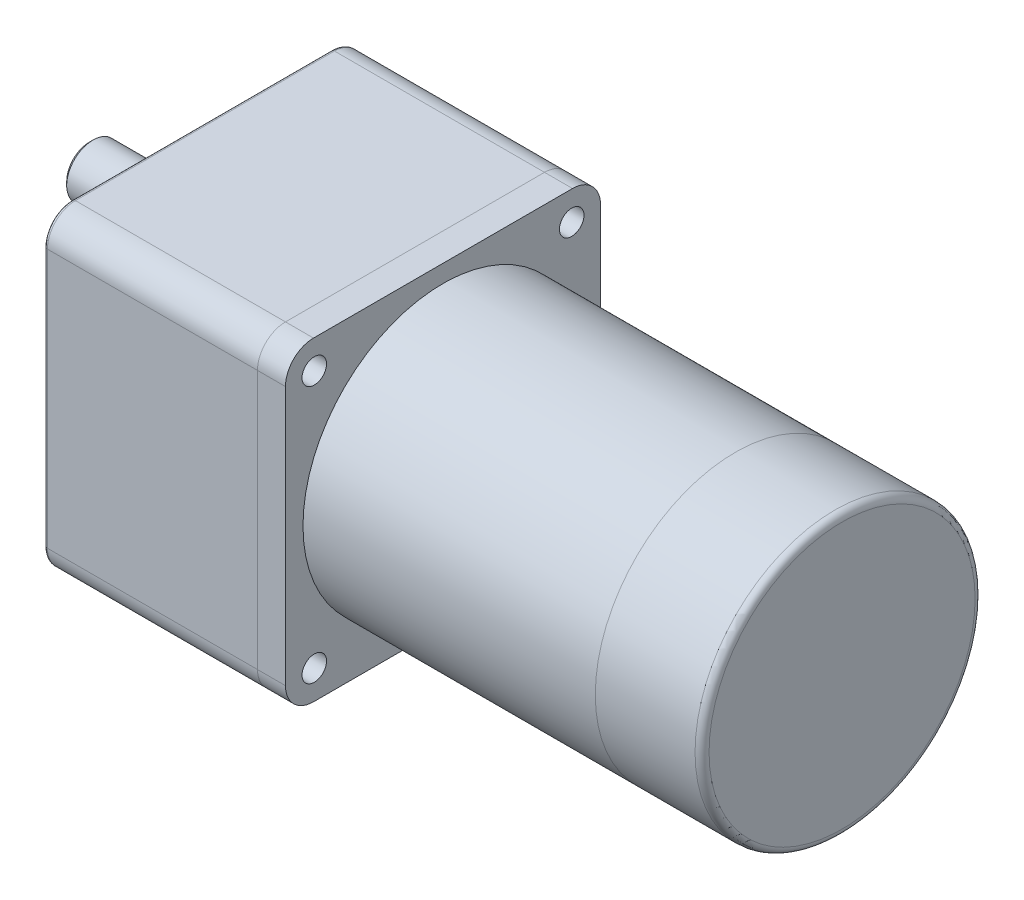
ISO-10303-21;
HEADER;
FILE_DESCRIPTION(('STEP AP214'),'2;1');
FILE_NAME('part.step','',(''),(''),'','','');
FILE_SCHEMA(('AUTOMOTIVE_DESIGN { 1 0 10303 214 1 1 1 1 }'));
ENDSEC;
DATA;
#1=APPLICATION_CONTEXT('core data for automotive mechanical design processes');
#2=APPLICATION_PROTOCOL_DEFINITION('international standard','automotive_design',2000,#1);
#3=PRODUCT_CONTEXT('',#1,'mechanical');
#4=PRODUCT('Part','Part','',(#3));
#5=PRODUCT_RELATED_PRODUCT_CATEGORY('part','',(#4));
#6=PRODUCT_DEFINITION_FORMATION('','',#4);
#7=PRODUCT_DEFINITION_CONTEXT('part definition',#1,'design');
#8=PRODUCT_DEFINITION('design','',#6,#7);
#9=PRODUCT_DEFINITION_SHAPE('','',#8);
#10=(LENGTH_UNIT() NAMED_UNIT(*) SI_UNIT(.MILLI.,.METRE.));
#11=(NAMED_UNIT(*) PLANE_ANGLE_UNIT() SI_UNIT($,.RADIAN.));
#12=(NAMED_UNIT(*) SI_UNIT($,.STERADIAN.) SOLID_ANGLE_UNIT());
#13=UNCERTAINTY_MEASURE_WITH_UNIT(LENGTH_MEASURE(1.E-05),#10,'distance_accuracy_value','');
#14=(GEOMETRIC_REPRESENTATION_CONTEXT(3) GLOBAL_UNCERTAINTY_ASSIGNED_CONTEXT((#13)) GLOBAL_UNIT_ASSIGNED_CONTEXT((#10,
#11,#12)) REPRESENTATION_CONTEXT('',''));
#15=CARTESIAN_POINT('',(0.,0.,0.));
#16=DIRECTION('',(0.,0.,1.));
#17=DIRECTION('',(1.,0.,0.));
#18=AXIS2_PLACEMENT_3D('',#15,#16,#17);
#19=CARTESIAN_POINT('',(-32.,18.,0.));
#20=DIRECTION('',(1.,0.,0.));
#21=DIRECTION('',(0.,0.,-1.));
#22=AXIS2_PLACEMENT_3D('',#19,#20,#21);
#23=CYLINDRICAL_SURFACE('',#22,7.5);
#24=CARTESIAN_POINT('',(-3.,18.,0.));
#25=DIRECTION('',(-1.,0.,0.));
#26=DIRECTION('',(0.,0.,1.));
#27=AXIS2_PLACEMENT_3D('',#24,#25,#26);
#28=CIRCLE('',#27,7.5);
#29=CARTESIAN_POINT('',(-3.,18.,7.5));
#30=VERTEX_POINT('',#29);
#31=EDGE_CURVE('E126',#30,#30,#28,.T.);
#32=ORIENTED_EDGE('',*,*,#31,.T.);
#33=EDGE_LOOP('',(#32));
#34=FACE_BOUND('',#33,.T.);
#35=DIRECTION('',(1.,0.,0.));
#36=VECTOR('',#35,1.);
#37=CARTESIAN_POINT('',(-32.,20.5,-7.07106781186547));
#38=LINE('',#37,#36);
#39=CARTESIAN_POINT('',(-31.,20.5,-7.07106781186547));
#40=VERTEX_POINT('',#39);
#41=CARTESIAN_POINT('',(-9.5,20.5,-7.07106781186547));
#42=VERTEX_POINT('',#41);
#43=EDGE_CURVE('E115',#40,#42,#38,.T.);
#44=ORIENTED_EDGE('',*,*,#43,.F.);
#45=CARTESIAN_POINT('',(-31.,18.,0.));
#46=DIRECTION('',(-1.,0.,0.));
#47=DIRECTION('',(0.,0.,1.));
#48=AXIS2_PLACEMENT_3D('',#45,#46,#47);
#49=CIRCLE('',#48,7.5);
#50=CARTESIAN_POINT('',(-31.,15.5,-7.07106781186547));
#51=VERTEX_POINT('',#50);
#52=EDGE_CURVE('E59',#40,#51,#49,.F.);
#53=ORIENTED_EDGE('',*,*,#52,.T.);
#54=DIRECTION('',(1.,0.,0.));
#55=VECTOR('',#54,1.);
#56=CARTESIAN_POINT('',(-32.,15.5,-7.07106781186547));
#57=LINE('',#56,#55);
#58=CARTESIAN_POINT('',(-9.5,15.5,-7.07106781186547));
#59=VERTEX_POINT('',#58);
#60=EDGE_CURVE('E117',#59,#51,#57,.F.);
#61=ORIENTED_EDGE('',*,*,#60,.F.);
#62=CARTESIAN_POINT('',(-9.5,20.5,-7.07106781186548));
#63=CARTESIAN_POINT('',(-9.43179292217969,20.5000089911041,-7.07105693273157));
#64=CARTESIAN_POINT('',(-9.36359192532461,20.4972088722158,-7.07205443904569));
#65=CARTESIAN_POINT('',(-9.22771896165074,20.4860604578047,-7.07598524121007));
#66=CARTESIAN_POINT('',(-9.16004685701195,20.477713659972,-7.07891801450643));
#67=CARTESIAN_POINT('',(-9.02590951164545,20.455574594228,-7.08662705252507));
#68=CARTESIAN_POINT('',(-8.95944129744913,20.4417984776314,-7.09139784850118));
#69=CARTESIAN_POINT('',(-8.8279917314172,20.4089418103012,-7.10262619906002));
#70=CARTESIAN_POINT('',(-8.7630104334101,20.3898610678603,-7.10908381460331));
#71=CARTESIAN_POINT('',(-8.57103842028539,20.324915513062,-7.13069940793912));
#72=CARTESIAN_POINT('',(-8.44682084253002,20.2713141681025,-7.14811243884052));
#73=CARTESIAN_POINT('',(-8.20912318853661,20.1451778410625,-7.1869703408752));
#74=CARTESIAN_POINT('',(-8.09564976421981,20.0726312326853,-7.20841768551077));
#75=CARTESIAN_POINT('',(-7.8782070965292,19.9076299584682,-7.25386182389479));
#76=CARTESIAN_POINT('',(-7.7747148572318,19.8145628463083,-7.27792189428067));
#77=CARTESIAN_POINT('',(-7.5844828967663,19.6124707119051,-7.32534626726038));
#78=CARTESIAN_POINT('',(-7.497746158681,19.5034428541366,-7.34871044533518));
#79=CARTESIAN_POINT('',(-7.34130177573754,19.2690092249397,-7.39284706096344));
#80=CARTESIAN_POINT('',(-7.27209769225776,19.1432502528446,-7.41353593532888));
#81=CARTESIAN_POINT('',(-7.1560192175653,18.8810730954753,-7.44924021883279));
#82=CARTESIAN_POINT('',(-7.10913800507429,18.7446581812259,-7.46425736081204));
#83=CARTESIAN_POINT('',(-7.04066072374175,18.4700733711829,-7.48647677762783));
#84=CARTESIAN_POINT('',(-7.01824182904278,18.3321295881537,-7.49393272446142));
#85=CARTESIAN_POINT('',(-6.99670924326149,18.0542474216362,-7.50109021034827));
#86=CARTESIAN_POINT('',(-6.99758999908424,17.9143095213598,-7.50079359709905));
#87=CARTESIAN_POINT('',(-7.0221107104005,17.6422403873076,-7.49265096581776));
#88=CARTESIAN_POINT('',(-7.04485659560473,17.5100182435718,-7.48510152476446));
#89=CARTESIAN_POINT('',(-7.1109829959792,17.2513898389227,-7.46367401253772));
#90=CARTESIAN_POINT('',(-7.15436465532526,17.1249839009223,-7.44979559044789));
#91=CARTESIAN_POINT('',(-7.26105342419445,16.8796184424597,-7.41689170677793));
#92=CARTESIAN_POINT('',(-7.32461511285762,16.760778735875,-7.39780094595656));
#93=CARTESIAN_POINT('',(-7.46964987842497,16.5351885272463,-7.35645969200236));
#94=CARTESIAN_POINT('',(-7.55112782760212,16.4284413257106,-7.33420833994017));
#95=CARTESIAN_POINT('',(-7.73417762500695,16.2247566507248,-7.28765679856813));
#96=CARTESIAN_POINT('',(-7.83651385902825,16.128515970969,-7.26330946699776));
#97=CARTESIAN_POINT('',(-8.05610372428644,15.9543199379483,-7.21618726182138));
#98=CARTESIAN_POINT('',(-8.17336215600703,15.8763704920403,-7.19341289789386));
#99=CARTESIAN_POINT('',(-8.42170044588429,15.7399916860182,-7.15175078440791));
#100=CARTESIAN_POINT('',(-8.55295878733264,15.6818674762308,-7.13292537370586));
#101=CARTESIAN_POINT('',(-8.8241174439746,15.5888494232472,-7.10202742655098));
#102=CARTESIAN_POINT('',(-8.96400373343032,15.5539189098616,-7.08994423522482));
#103=CARTESIAN_POINT('',(-9.17104659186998,15.5208546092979,-7.078413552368));
#104=CARTESIAN_POINT('',(-9.23660347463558,15.5130373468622,-7.07566669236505));
#105=CARTESIAN_POINT('',(-9.36809519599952,15.502613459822,-7.07199258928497));
#106=CARTESIAN_POINT('',(-9.43402943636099,15.5000001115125,-7.0710629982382));
#107=CARTESIAN_POINT('',(-9.5,15.5,-7.07106781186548));
#108=B_SPLINE_CURVE_WITH_KNOTS('',3,(#62,#63,#64,#65,#66,#67,#68,#69,#70,#71,#72,#73,#74,#75,
#76,#77,#78,#79,#80,#81,#82,#83,#84,#85,#86,#87,#88,#89,#90,#91,#92,#93,#94,#95,#96,#97,#98,#99,
#100,#101,#102,#103,#104,#105,#106,#107),.UNSPECIFIED.,.F.,.F.,(4,2,2,2,2,2,2,2,2,2,2,2,2,2,2,2,
2,2,2,2,2,2,4),(0.,0.20454621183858,0.409037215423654,0.612924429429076,0.816819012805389,
1.22401016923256,1.63145179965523,2.0532786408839,2.47518051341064,2.90809434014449,
3.34087579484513,3.75860278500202,4.17623021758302,4.57747647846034,4.97874498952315,
5.38529148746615,5.79194868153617,6.21771736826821,6.64362337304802,7.07581676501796,
7.50732520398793,7.70536340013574,7.90314555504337),.UNSPECIFIED.);
#109=EDGE_CURVE('E129',#42,#59,#108,.T.);
#110=ORIENTED_EDGE('',*,*,#109,.F.);
#111=EDGE_LOOP('',(#44,#53,#61,#110));
#112=FACE_BOUND('',#111,.T.);
#113=ADVANCED_FACE('F46',(#34,#112),#23,.T.);
#114=CARTESIAN_POINT('',(-32.,18.,0.));
#115=DIRECTION('',(-1.,0.,0.));
#116=DIRECTION('',(0.,0.,1.));
#117=AXIS2_PLACEMENT_3D('',#114,#115,#116);
#118=PLANE('',#117);
#119=DIRECTION('',(0.,0.,-1.));
#120=VECTOR('',#119,1.);
#121=CARTESIAN_POINT('',(-32.,15.5,-4.5));
#122=LINE('',#121,#120);
#123=CARTESIAN_POINT('',(-32.,15.5,-4.5));
#124=VERTEX_POINT('',#123);
#125=CARTESIAN_POINT('',(-32.,15.5,-6.00000000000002));
#126=VERTEX_POINT('',#125);
#127=EDGE_CURVE('E121',#124,#126,#122,.T.);
#128=ORIENTED_EDGE('',*,*,#127,.T.);
#129=CARTESIAN_POINT('',(-32.,18.,0.));
#130=DIRECTION('',(-1.,0.,0.));
#131=DIRECTION('',(0.,0.,1.));
#132=AXIS2_PLACEMENT_3D('',#129,#130,#131);
#133=CIRCLE('',#132,6.50000000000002);
#134=CARTESIAN_POINT('',(-32.,20.5,-6.00000000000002));
#135=VERTEX_POINT('',#134);
#136=EDGE_CURVE('E135',#126,#135,#133,.T.);
#137=ORIENTED_EDGE('',*,*,#136,.T.);
#138=DIRECTION('',(0.,0.,-1.));
#139=VECTOR('',#138,1.);
#140=CARTESIAN_POINT('',(-32.,20.5,-4.5));
#141=LINE('',#140,#139);
#142=CARTESIAN_POINT('',(-32.,20.5,-4.5));
#143=VERTEX_POINT('',#142);
#144=EDGE_CURVE('E118',#143,#135,#141,.T.);
#145=ORIENTED_EDGE('',*,*,#144,.F.);
#146=DIRECTION('',(0.,-1.,0.));
#147=VECTOR('',#146,1.);
#148=CARTESIAN_POINT('',(-32.,20.5,-4.5));
#149=LINE('',#148,#147);
#150=EDGE_CURVE('E102',#143,#124,#149,.T.);
#151=ORIENTED_EDGE('',*,*,#150,.T.);
#152=EDGE_LOOP('',(#128,#137,#145,#151));
#153=FACE_BOUND('',#152,.T.);
#154=ADVANCED_FACE('F145',(#153),#118,.T.);
#155=CARTESIAN_POINT('',(-3.,18.,0.));
#156=DIRECTION('',(-1.,0.,0.));
#157=DIRECTION('',(0.,0.,1.));
#158=AXIS2_PLACEMENT_3D('',#155,#156,#157);
#159=PLANE('',#158);
#160=ORIENTED_EDGE('',*,*,#31,.F.);
#161=EDGE_LOOP('',(#160));
#162=FACE_BOUND('',#161,.T.);
#163=ADVANCED_FACE('F143',(#162),#159,.F.);
#164=CARTESIAN_POINT('',(-9.5,18.,-4.5));
#165=DIRECTION('',(0.,0.,-1.));
#166=DIRECTION('',(-1.,0.,0.));
#167=AXIS2_PLACEMENT_3D('',#164,#165,#166);
#168=CYLINDRICAL_SURFACE('',#167,2.5);
#169=DIRECTION('',(0.,0.,-1.));
#170=VECTOR('',#169,1.);
#171=CARTESIAN_POINT('',(-9.5,20.5,-4.5));
#172=LINE('',#171,#170);
#173=CARTESIAN_POINT('',(-9.5,20.5,-4.5));
#174=VERTEX_POINT('',#173);
#175=EDGE_CURVE('E110',#174,#42,#172,.T.);
#176=ORIENTED_EDGE('',*,*,#175,.T.);
#177=ORIENTED_EDGE('',*,*,#109,.T.);
#178=DIRECTION('',(0.,0.,-1.));
#179=VECTOR('',#178,1.);
#180=CARTESIAN_POINT('',(-9.5,15.5,-4.5));
#181=LINE('',#180,#179);
#182=CARTESIAN_POINT('',(-9.5,15.5,-4.5));
#183=VERTEX_POINT('',#182);
#184=EDGE_CURVE('E112',#183,#59,#181,.T.);
#185=ORIENTED_EDGE('',*,*,#184,.F.);
#186=CARTESIAN_POINT('',(-9.5,18.,-4.5));
#187=DIRECTION('',(0.,0.,1.));
#188=DIRECTION('',(1.,0.,0.));
#189=AXIS2_PLACEMENT_3D('',#186,#187,#188);
#190=CIRCLE('',#189,2.5);
#191=EDGE_CURVE('E100',#183,#174,#190,.T.);
#192=ORIENTED_EDGE('',*,*,#191,.T.);
#193=EDGE_LOOP('',(#176,#177,#185,#192));
#194=FACE_BOUND('',#193,.T.);
#195=ADVANCED_FACE('F109',(#194),#168,.F.);
#196=CARTESIAN_POINT('',(-9.5,20.5,-4.5));
#197=DIRECTION('',(0.,-1.,0.));
#198=DIRECTION('',(0.,0.,-1.));
#199=AXIS2_PLACEMENT_3D('',#196,#197,#198);
#200=PLANE('',#199);
#201=ORIENTED_EDGE('',*,*,#144,.T.);
#202=CARTESIAN_POINT('',(-32.,20.5,-6.00000000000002));
#203=CARTESIAN_POINT('',(-31.9171731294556,20.5,-6.0897273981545));
#204=CARTESIAN_POINT('',(-31.8341996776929,20.5,-6.17931930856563));
#205=CARTESIAN_POINT('',(-31.6679908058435,20.5,-6.35825867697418));
#206=CARTESIAN_POINT('',(-31.5847553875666,20.5,-6.44760613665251));
#207=CARTESIAN_POINT('',(-31.4180527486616,20.5,-6.62608424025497));
#208=CARTESIAN_POINT('',(-31.3345855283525,20.5,-6.7152148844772));
#209=CARTESIAN_POINT('',(-31.1674427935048,20.5,-6.89328182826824));
#210=CARTESIAN_POINT('',(-31.0837672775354,20.5,-6.98221812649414));
#211=CARTESIAN_POINT('',(-31.,20.5,-7.07106781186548));
#212=B_SPLINE_CURVE_WITH_KNOTS('',3,(#202,#203,#204,#205,#206,#207,#208,#209,#210,#211),
.UNSPECIFIED.,.F.,.F.,(4,2,2,2,4),(0.,0.366335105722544,0.732667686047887,1.0989997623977,
1.46533436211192),.UNSPECIFIED.);
#213=EDGE_CURVE('E73',#135,#40,#212,.T.);
#214=ORIENTED_EDGE('',*,*,#213,.T.);
#215=ORIENTED_EDGE('',*,*,#43,.T.);
#216=ORIENTED_EDGE('',*,*,#175,.F.);
#217=DIRECTION('',(-1.,0.,0.));
#218=VECTOR('',#217,1.);
#219=CARTESIAN_POINT('',(-9.5,20.5,-4.5));
#220=LINE('',#219,#218);
#221=EDGE_CURVE('E97',#174,#143,#220,.T.);
#222=ORIENTED_EDGE('',*,*,#221,.T.);
#223=EDGE_LOOP('',(#201,#214,#215,#216,#222));
#224=FACE_BOUND('',#223,.T.);
#225=ADVANCED_FACE('F114',(#224),#200,.T.);
#226=CARTESIAN_POINT('',(-32.,15.5,-4.5));
#227=DIRECTION('',(0.,1.,0.));
#228=DIRECTION('',(0.,0.,1.));
#229=AXIS2_PLACEMENT_3D('',#226,#227,#228);
#230=PLANE('',#229);
#231=ORIENTED_EDGE('',*,*,#60,.T.);
#232=CARTESIAN_POINT('',(-31.,15.5,-7.07106781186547));
#233=CARTESIAN_POINT('',(-31.0837672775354,15.5,-6.98221812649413));
#234=CARTESIAN_POINT('',(-31.1674427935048,15.5,-6.89328182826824));
#235=CARTESIAN_POINT('',(-31.3345855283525,15.5,-6.7152148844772));
#236=CARTESIAN_POINT('',(-31.4180527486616,15.5,-6.62608424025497));
#237=CARTESIAN_POINT('',(-31.5847553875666,15.5,-6.44760613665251));
#238=CARTESIAN_POINT('',(-31.6679908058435,15.5,-6.35825867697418));
#239=CARTESIAN_POINT('',(-31.8341996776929,15.5,-6.17931930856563));
#240=CARTESIAN_POINT('',(-31.9171731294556,15.5,-6.08972739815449));
#241=CARTESIAN_POINT('',(-32.,15.5,-6.00000000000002));
#242=B_SPLINE_CURVE_WITH_KNOTS('',3,(#232,#233,#234,#235,#236,#237,#238,#239,#240,#241),
.UNSPECIFIED.,.F.,.F.,(4,2,2,2,4),(0.,0.366334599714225,0.732666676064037,1.09899925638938,
1.46533436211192),.UNSPECIFIED.);
#243=EDGE_CURVE('E12',#51,#126,#242,.T.);
#244=ORIENTED_EDGE('',*,*,#243,.T.);
#245=ORIENTED_EDGE('',*,*,#127,.F.);
#246=DIRECTION('',(1.,0.,0.));
#247=VECTOR('',#246,1.);
#248=CARTESIAN_POINT('',(-32.,15.5,-4.5));
#249=LINE('',#248,#247);
#250=EDGE_CURVE('E167',#124,#183,#249,.T.);
#251=ORIENTED_EDGE('',*,*,#250,.T.);
#252=ORIENTED_EDGE('',*,*,#184,.T.);
#253=EDGE_LOOP('',(#231,#244,#245,#251,#252));
#254=FACE_BOUND('',#253,.T.);
#255=ADVANCED_FACE('F171',(#254),#230,.T.);
#256=CARTESIAN_POINT('',(-9.5,18.,-4.5));
#257=DIRECTION('',(0.,0.,1.));
#258=DIRECTION('',(1.,0.,0.));
#259=AXIS2_PLACEMENT_3D('',#256,#257,#258);
#260=PLANE('',#259);
#261=ORIENTED_EDGE('',*,*,#191,.F.);
#262=ORIENTED_EDGE('',*,*,#250,.F.);
#263=ORIENTED_EDGE('',*,*,#150,.F.);
#264=ORIENTED_EDGE('',*,*,#221,.F.);
#265=EDGE_LOOP('',(#261,#262,#263,#264));
#266=FACE_BOUND('',#265,.T.);
#267=ADVANCED_FACE('F99',(#266),#260,.F.);
#268=CARTESIAN_POINT('',(-32.,18.,0.));
#269=DIRECTION('',(1.,0.,0.));
#270=DIRECTION('',(0.,0.,-1.));
#271=AXIS2_PLACEMENT_3D('',#268,#269,#270);
#272=CONICAL_SURFACE('',#271,6.50000000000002,0.785398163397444);
#273=ORIENTED_EDGE('',*,*,#243,.F.);
#274=ORIENTED_EDGE('',*,*,#52,.F.);
#275=ORIENTED_EDGE('',*,*,#213,.F.);
#276=ORIENTED_EDGE('',*,*,#136,.F.);
#277=EDGE_LOOP('',(#273,#274,#275,#276));
#278=FACE_BOUND('',#277,.T.);
#279=ADVANCED_FACE('F48',(#278),#272,.T.);
#280=CLOSED_SHELL('',(#113,#154,#163,#195,#225,#255,#267,#279));
#281=MANIFOLD_SOLID_BREP('B2',#280);
#282=CARTESIAN_POINT('',(-3.,18.,0.));
#283=DIRECTION('',(1.,0.,0.));
#284=DIRECTION('',(0.,0.,-1.));
#285=AXIS2_PLACEMENT_3D('',#282,#283,#284);
#286=CYLINDRICAL_SURFACE('',#285,16.);
#287=CARTESIAN_POINT('',(-2.5,18.,0.));
#288=DIRECTION('',(-1.,0.,0.));
#289=DIRECTION('',(0.,0.,1.));
#290=AXIS2_PLACEMENT_3D('',#287,#288,#289);
#291=CIRCLE('',#290,16.);
#292=CARTESIAN_POINT('',(-2.5,18.,16.));
#293=VERTEX_POINT('',#292);
#294=EDGE_CURVE('E45',#293,#293,#291,.F.);
#295=ORIENTED_EDGE('',*,*,#294,.T.);
#296=EDGE_LOOP('',(#295));
#297=FACE_BOUND('',#296,.T.);
#298=CARTESIAN_POINT('',(0.,18.,0.));
#299=DIRECTION('',(-1.,0.,0.));
#300=DIRECTION('',(0.,0.,1.));
#301=AXIS2_PLACEMENT_3D('',#298,#299,#300);
#302=CIRCLE('',#301,16.);
#303=CARTESIAN_POINT('',(0.,18.,16.));
#304=VERTEX_POINT('',#303);
#305=EDGE_CURVE('E245',#304,#304,#302,.T.);
#306=ORIENTED_EDGE('',*,*,#305,.T.);
#307=EDGE_LOOP('',(#306));
#308=FACE_BOUND('',#307,.T.);
#309=ADVANCED_FACE('F234',(#297,#308),#286,.T.);
#310=CARTESIAN_POINT('',(-3.,18.,0.));
#311=DIRECTION('',(-1.,0.,0.));
#312=DIRECTION('',(0.,0.,1.));
#313=AXIS2_PLACEMENT_3D('',#310,#311,#312);
#314=PLANE('',#313);
#315=CARTESIAN_POINT('',(-3.,18.,0.));
#316=DIRECTION('',(-1.,0.,0.));
#317=DIRECTION('',(0.,0.,1.));
#318=AXIS2_PLACEMENT_3D('',#315,#316,#317);
#319=CIRCLE('',#318,15.5);
#320=CARTESIAN_POINT('',(-3.,18.,15.5));
#321=VERTEX_POINT('',#320);
#322=EDGE_CURVE('E241',#321,#321,#319,.T.);
#323=ORIENTED_EDGE('',*,*,#322,.T.);
#324=EDGE_LOOP('',(#323));
#325=FACE_BOUND('',#324,.T.);
#326=ADVANCED_FACE('F255',(#325),#314,.T.);
#327=CARTESIAN_POINT('',(0.,18.,0.));
#328=DIRECTION('',(-1.,0.,0.));
#329=DIRECTION('',(0.,0.,1.));
#330=AXIS2_PLACEMENT_3D('',#327,#328,#329);
#331=PLANE('',#330);
#332=ORIENTED_EDGE('',*,*,#305,.F.);
#333=EDGE_LOOP('',(#332));
#334=FACE_BOUND('',#333,.T.);
#335=ADVANCED_FACE('F253',(#334),#331,.F.);
#336=CARTESIAN_POINT('',(-2.5,18.,0.));
#337=DIRECTION('',(-1.,0.,0.));
#338=DIRECTION('',(0.,0.,1.));
#339=AXIS2_PLACEMENT_3D('',#336,#337,#338);
#340=TOROIDAL_SURFACE('',#339,15.5,0.5);
#341=ORIENTED_EDGE('',*,*,#294,.F.);
#342=EDGE_LOOP('',(#341));
#343=FACE_BOUND('',#342,.T.);
#344=ORIENTED_EDGE('',*,*,#322,.F.);
#345=EDGE_LOOP('',(#344));
#346=FACE_BOUND('',#345,.T.);
#347=ADVANCED_FACE('F236',(#343,#346),#340,.T.);
#348=CLOSED_SHELL('',(#309,#326,#335,#347));
#349=MANIFOLD_SOLID_BREP('B6',#348);
#350=CARTESIAN_POINT('',(183.,0.,0.));
#351=DIRECTION('',(-1.,0.,0.));
#352=DIRECTION('',(0.,0.,1.));
#353=AXIS2_PLACEMENT_3D('',#350,#351,#352);
#354=CYLINDRICAL_SURFACE('',#353,40.);
#355=CARTESIAN_POINT('',(181.,0.,0.));
#356=DIRECTION('',(1.,0.,0.));
#357=DIRECTION('',(0.,0.,-1.));
#358=AXIS2_PLACEMENT_3D('',#355,#356,#357);
#359=CIRCLE('',#358,40.);
#360=CARTESIAN_POINT('',(181.,0.,40.));
#361=VERTEX_POINT('',#360);
#362=EDGE_CURVE('E233',#361,#361,#359,.F.);
#363=CARTESIAN_POINT('',(152.5,0.,0.));
#364=DIRECTION('',(1.,0.,0.));
#365=DIRECTION('',(0.,0.,-1.));
#366=AXIS2_PLACEMENT_3D('',#363,#364,#365);
#367=CIRCLE('',#366,40.);
#368=CARTESIAN_POINT('',(152.5,0.,40.));
#369=VERTEX_POINT('',#368);
#370=EDGE_CURVE('E309',#369,#369,#367,.T.);
#371=CARTESIAN_POINT('',(181.,0.,40.));
#372=CARTESIAN_POINT('',(180.703125,0.,40.));
#373=CARTESIAN_POINT('',(180.40625,0.,40.));
#374=CARTESIAN_POINT('',(179.8125,0.,40.));
#375=CARTESIAN_POINT('',(179.515625,0.,40.));
#376=CARTESIAN_POINT('',(178.921875,0.,40.));
#377=CARTESIAN_POINT('',(178.625,0.,40.));
#378=CARTESIAN_POINT('',(178.03125,0.,40.));
#379=CARTESIAN_POINT('',(177.734375,0.,40.));
#380=CARTESIAN_POINT('',(177.140625,0.,40.));
#381=CARTESIAN_POINT('',(176.84375,0.,40.));
#382=CARTESIAN_POINT('',(176.25,0.,40.));
#383=CARTESIAN_POINT('',(175.953125,0.,40.));
#384=CARTESIAN_POINT('',(175.359375,0.,40.));
#385=CARTESIAN_POINT('',(175.0625,0.,40.));
#386=CARTESIAN_POINT('',(174.46875,0.,40.));
#387=CARTESIAN_POINT('',(174.171875,0.,40.));
#388=CARTESIAN_POINT('',(173.578125,0.,40.));
#389=CARTESIAN_POINT('',(173.28125,0.,40.));
#390=CARTESIAN_POINT('',(172.6875,0.,40.));
#391=CARTESIAN_POINT('',(172.390625,0.,40.));
#392=CARTESIAN_POINT('',(171.796875,0.,40.));
#393=CARTESIAN_POINT('',(171.5,0.,40.));
#394=CARTESIAN_POINT('',(170.90625,0.,40.));
#395=CARTESIAN_POINT('',(170.609375,0.,40.));
#396=CARTESIAN_POINT('',(170.015625,0.,40.));
#397=CARTESIAN_POINT('',(169.71875,0.,40.));
#398=CARTESIAN_POINT('',(169.125,0.,40.));
#399=CARTESIAN_POINT('',(168.828125,0.,40.));
#400=CARTESIAN_POINT('',(168.234375,0.,40.));
#401=CARTESIAN_POINT('',(167.9375,0.,40.));
#402=CARTESIAN_POINT('',(167.34375,0.,40.));
#403=CARTESIAN_POINT('',(167.046875,0.,40.));
#404=CARTESIAN_POINT('',(166.453125,0.,40.));
#405=CARTESIAN_POINT('',(166.15625,0.,40.));
#406=CARTESIAN_POINT('',(165.5625,0.,40.));
#407=CARTESIAN_POINT('',(165.265625,0.,40.));
#408=CARTESIAN_POINT('',(164.671875,0.,40.));
#409=CARTESIAN_POINT('',(164.375,0.,40.));
#410=CARTESIAN_POINT('',(163.78125,0.,40.));
#411=CARTESIAN_POINT('',(163.484375,0.,40.));
#412=CARTESIAN_POINT('',(162.890625,0.,40.));
#413=CARTESIAN_POINT('',(162.59375,0.,40.));
#414=CARTESIAN_POINT('',(162.,0.,40.));
#415=CARTESIAN_POINT('',(161.703125,0.,40.));
#416=CARTESIAN_POINT('',(161.109375,0.,40.));
#417=CARTESIAN_POINT('',(160.8125,0.,40.));
#418=CARTESIAN_POINT('',(160.21875,0.,40.));
#419=CARTESIAN_POINT('',(159.921875,0.,40.));
#420=CARTESIAN_POINT('',(159.328125,0.,40.));
#421=CARTESIAN_POINT('',(159.03125,0.,40.));
#422=CARTESIAN_POINT('',(158.4375,0.,40.));
#423=CARTESIAN_POINT('',(158.140625,0.,40.));
#424=CARTESIAN_POINT('',(157.546875,0.,40.));
#425=CARTESIAN_POINT('',(157.25,0.,40.));
#426=CARTESIAN_POINT('',(156.65625,0.,40.));
#427=CARTESIAN_POINT('',(156.359375,0.,40.));
#428=CARTESIAN_POINT('',(155.765625,0.,40.));
#429=CARTESIAN_POINT('',(155.46875,0.,40.));
#430=CARTESIAN_POINT('',(154.875,0.,40.));
#431=CARTESIAN_POINT('',(154.578125,0.,40.));
#432=CARTESIAN_POINT('',(153.984375,0.,40.));
#433=CARTESIAN_POINT('',(153.6875,0.,40.));
#434=CARTESIAN_POINT('',(153.09375,0.,40.));
#435=CARTESIAN_POINT('',(152.796875,0.,40.));
#436=CARTESIAN_POINT('',(152.5,0.,40.));
#437=B_SPLINE_CURVE_WITH_KNOTS('',3,(#371,#372,#373,#374,#375,#376,#377,#378,#379,#380,#381,
#382,#383,#384,#385,#386,#387,#388,#389,#390,#391,#392,#393,#394,#395,#396,#397,#398,#399,#400,
#401,#402,#403,#404,#405,#406,#407,#408,#409,#410,#411,#412,#413,#414,#415,#416,#417,#418,#419,
#420,#421,#422,#423,#424,#425,#426,#427,#428,#429,#430,#431,#432,#433,#434,#435,#436),
.UNSPECIFIED.,.F.,.F.,(4,2,2,2,2,2,2,2,2,2,2,2,2,2,2,2,2,2,2,2,2,2,2,2,2,2,2,2,2,2,2,2,4),(0.,
0.890625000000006,1.78125000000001,2.67187500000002,3.56250000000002,4.453125,5.34375000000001,
6.23437500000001,7.12500000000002,8.01562500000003,8.90625,9.79687500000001,10.6875,11.578125,
12.46875,13.359375,14.25,15.140625,16.03125,16.921875,17.8125,18.703125,19.59375,20.484375,
21.375,22.265625,23.15625,24.046875,24.9375,25.828125,26.71875,27.609375,28.5),.UNSPECIFIED.);
#438=EDGE_CURVE('BSEAM298',#361,#369,#437,.T.);
#439=ORIENTED_EDGE('',*,*,#362,.T.);
#440=ORIENTED_EDGE('',*,*,#370,.T.);
#441=ORIENTED_EDGE('',*,*,#438,.T.);
#442=ORIENTED_EDGE('',*,*,#438,.F.);
#443=EDGE_LOOP('',(#439,#441,#440,#442));
#444=FACE_BOUND('',#443,.T.);
#445=ADVANCED_FACE('F298',(#444),#354,.T.);
#446=CARTESIAN_POINT('',(183.,0.,0.));
#447=DIRECTION('',(1.,0.,0.));
#448=DIRECTION('',(0.,0.,-1.));
#449=AXIS2_PLACEMENT_3D('',#446,#447,#448);
#450=PLANE('',#449);
#451=CARTESIAN_POINT('',(183.,0.,0.));
#452=DIRECTION('',(1.,0.,0.));
#453=DIRECTION('',(0.,0.,-1.));
#454=AXIS2_PLACEMENT_3D('',#451,#452,#453);
#455=CIRCLE('',#454,38.);
#456=CARTESIAN_POINT('',(183.,0.,-38.));
#457=VERTEX_POINT('',#456);
#458=EDGE_CURVE('E305',#457,#457,#455,.T.);
#459=ORIENTED_EDGE('',*,*,#458,.T.);
#460=EDGE_LOOP('',(#459));
#461=FACE_BOUND('',#460,.T.);
#462=ADVANCED_FACE('F319',(#461),#450,.T.);
#463=CARTESIAN_POINT('',(152.5,0.,0.));
#464=DIRECTION('',(1.,0.,0.));
#465=DIRECTION('',(0.,0.,-1.));
#466=AXIS2_PLACEMENT_3D('',#463,#464,#465);
#467=PLANE('',#466);
#468=ORIENTED_EDGE('',*,*,#370,.F.);
#469=EDGE_LOOP('',(#468));
#470=FACE_BOUND('',#469,.T.);
#471=ADVANCED_FACE('F317',(#470),#467,.F.);
#472=CARTESIAN_POINT('',(181.,0.,0.));
#473=DIRECTION('',(1.,0.,0.));
#474=DIRECTION('',(0.,0.,-1.));
#475=AXIS2_PLACEMENT_3D('',#472,#473,#474);
#476=TOROIDAL_SURFACE('',#475,38.,2.);
#477=ORIENTED_EDGE('',*,*,#362,.F.);
#478=EDGE_LOOP('',(#477));
#479=FACE_BOUND('',#478,.T.);
#480=ORIENTED_EDGE('',*,*,#458,.F.);
#481=EDGE_LOOP('',(#480));
#482=FACE_BOUND('',#481,.T.);
#483=ADVANCED_FACE('F300',(#479,#482),#476,.T.);
#484=CLOSED_SHELL('',(#445,#462,#471,#483));
#485=MANIFOLD_SOLID_BREP('B40',#484);
#486=CARTESIAN_POINT('',(152.5,0.,0.));
#487=DIRECTION('',(-1.,0.,0.));
#488=DIRECTION('',(0.,0.,1.));
#489=AXIS2_PLACEMENT_3D('',#486,#487,#488);
#490=CYLINDRICAL_SURFACE('',#489,40.);
#491=CARTESIAN_POINT('',(152.5,0.,0.));
#492=DIRECTION('',(1.,0.,0.));
#493=DIRECTION('',(0.,0.,-1.));
#494=AXIS2_PLACEMENT_3D('',#491,#492,#493);
#495=CIRCLE('',#494,40.);
#496=CARTESIAN_POINT('',(152.5,0.,40.));
#497=VERTEX_POINT('',#496);
#498=EDGE_CURVE('E297',#497,#497,#495,.T.);
#499=CARTESIAN_POINT('',(69.,0.,0.));
#500=DIRECTION('',(1.,0.,0.));
#501=DIRECTION('',(0.,0.,-1.));
#502=AXIS2_PLACEMENT_3D('',#499,#500,#501);
#503=CIRCLE('',#502,40.);
#504=CARTESIAN_POINT('',(69.,0.,40.));
#505=VERTEX_POINT('',#504);
#506=EDGE_CURVE('E367',#505,#505,#503,.T.);
#507=CARTESIAN_POINT('',(152.5,0.,40.));
#508=CARTESIAN_POINT('',(151.630208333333,0.,40.));
#509=CARTESIAN_POINT('',(150.760416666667,0.,40.));
#510=CARTESIAN_POINT('',(149.020833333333,0.,40.));
#511=CARTESIAN_POINT('',(148.151041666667,0.,40.));
#512=CARTESIAN_POINT('',(146.411458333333,0.,40.));
#513=CARTESIAN_POINT('',(145.541666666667,0.,40.));
#514=CARTESIAN_POINT('',(143.802083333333,0.,40.));
#515=CARTESIAN_POINT('',(142.932291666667,0.,40.));
#516=CARTESIAN_POINT('',(141.192708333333,0.,40.));
#517=CARTESIAN_POINT('',(140.322916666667,0.,40.));
#518=CARTESIAN_POINT('',(138.583333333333,0.,40.));
#519=CARTESIAN_POINT('',(137.713541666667,0.,40.));
#520=CARTESIAN_POINT('',(135.973958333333,0.,40.));
#521=CARTESIAN_POINT('',(135.104166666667,0.,40.));
#522=CARTESIAN_POINT('',(133.364583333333,0.,40.));
#523=CARTESIAN_POINT('',(132.494791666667,0.,40.));
#524=CARTESIAN_POINT('',(130.755208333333,0.,40.));
#525=CARTESIAN_POINT('',(129.885416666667,0.,40.));
#526=CARTESIAN_POINT('',(128.145833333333,0.,40.));
#527=CARTESIAN_POINT('',(127.276041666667,0.,40.));
#528=CARTESIAN_POINT('',(125.536458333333,0.,40.));
#529=CARTESIAN_POINT('',(124.666666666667,0.,40.));
#530=CARTESIAN_POINT('',(122.927083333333,0.,40.));
#531=CARTESIAN_POINT('',(122.057291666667,0.,40.));
#532=CARTESIAN_POINT('',(120.317708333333,0.,40.));
#533=CARTESIAN_POINT('',(119.447916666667,0.,40.));
#534=CARTESIAN_POINT('',(117.708333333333,0.,40.));
#535=CARTESIAN_POINT('',(116.838541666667,0.,40.));
#536=CARTESIAN_POINT('',(115.098958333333,0.,40.));
#537=CARTESIAN_POINT('',(114.229166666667,0.,40.));
#538=CARTESIAN_POINT('',(112.489583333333,0.,40.));
#539=CARTESIAN_POINT('',(111.619791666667,0.,40.));
#540=CARTESIAN_POINT('',(109.880208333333,0.,40.));
#541=CARTESIAN_POINT('',(109.010416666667,0.,40.));
#542=CARTESIAN_POINT('',(107.270833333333,0.,40.));
#543=CARTESIAN_POINT('',(106.401041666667,0.,40.));
#544=CARTESIAN_POINT('',(104.661458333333,0.,40.));
#545=CARTESIAN_POINT('',(103.791666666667,0.,40.));
#546=CARTESIAN_POINT('',(102.052083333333,0.,40.));
#547=CARTESIAN_POINT('',(101.182291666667,0.,40.));
#548=CARTESIAN_POINT('',(99.4427083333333,0.,40.));
#549=CARTESIAN_POINT('',(98.5729166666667,0.,40.));
#550=CARTESIAN_POINT('',(96.8333333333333,0.,40.));
#551=CARTESIAN_POINT('',(95.9635416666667,0.,40.));
#552=CARTESIAN_POINT('',(94.2239583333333,0.,40.));
#553=CARTESIAN_POINT('',(93.3541666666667,0.,40.));
#554=CARTESIAN_POINT('',(91.6145833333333,0.,40.));
#555=CARTESIAN_POINT('',(90.7447916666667,0.,40.));
#556=CARTESIAN_POINT('',(89.0052083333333,0.,40.));
#557=CARTESIAN_POINT('',(88.1354166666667,0.,40.));
#558=CARTESIAN_POINT('',(86.3958333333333,0.,40.));
#559=CARTESIAN_POINT('',(85.5260416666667,0.,40.));
#560=CARTESIAN_POINT('',(83.7864583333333,0.,40.));
#561=CARTESIAN_POINT('',(82.9166666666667,0.,40.));
#562=CARTESIAN_POINT('',(81.1770833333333,0.,40.));
#563=CARTESIAN_POINT('',(80.3072916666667,0.,40.));
#564=CARTESIAN_POINT('',(78.5677083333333,0.,40.));
#565=CARTESIAN_POINT('',(77.6979166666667,0.,40.));
#566=CARTESIAN_POINT('',(75.9583333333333,0.,40.));
#567=CARTESIAN_POINT('',(75.0885416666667,0.,40.));
#568=CARTESIAN_POINT('',(73.3489583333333,0.,40.));
#569=CARTESIAN_POINT('',(72.4791666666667,0.,40.));
#570=CARTESIAN_POINT('',(70.7395833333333,0.,40.));
#571=CARTESIAN_POINT('',(69.8697916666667,0.,40.));
#572=CARTESIAN_POINT('',(69.,0.,40.));
#573=B_SPLINE_CURVE_WITH_KNOTS('',3,(#507,#508,#509,#510,#511,#512,#513,#514,#515,#516,#517,
#518,#519,#520,#521,#522,#523,#524,#525,#526,#527,#528,#529,#530,#531,#532,#533,#534,#535,#536,
#537,#538,#539,#540,#541,#542,#543,#544,#545,#546,#547,#548,#549,#550,#551,#552,#553,#554,#555,
#556,#557,#558,#559,#560,#561,#562,#563,#564,#565,#566,#567,#568,#569,#570,#571,#572),
.UNSPECIFIED.,.F.,.F.,(4,2,2,2,2,2,2,2,2,2,2,2,2,2,2,2,2,2,2,2,2,2,2,2,2,2,2,2,2,2,2,2,4),(0.,
2.609375,5.21874999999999,7.82812499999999,10.4375,13.046875,15.65625,18.265625,20.875,
23.484375,26.09375,28.703125,31.3125,33.921875,36.53125,39.140625,41.75,44.359375,46.96875,
49.578125,52.1875,54.796875,57.40625,60.015625,62.625,65.234375,67.84375,70.453125,73.0625,
75.671875,78.28125,80.890625,83.5),.UNSPECIFIED.);
#574=EDGE_CURVE('BSEAM364',#497,#505,#573,.T.);
#575=ORIENTED_EDGE('',*,*,#498,.F.);
#576=ORIENTED_EDGE('',*,*,#506,.T.);
#577=ORIENTED_EDGE('',*,*,#574,.T.);
#578=ORIENTED_EDGE('',*,*,#574,.F.);
#579=EDGE_LOOP('',(#575,#577,#576,#578));
#580=FACE_BOUND('',#579,.T.);
#581=ADVANCED_FACE('F364',(#580),#490,.T.);
#582=CARTESIAN_POINT('',(152.5,0.,0.));
#583=DIRECTION('',(1.,0.,0.));
#584=DIRECTION('',(0.,0.,-1.));
#585=AXIS2_PLACEMENT_3D('',#582,#583,#584);
#586=PLANE('',#585);
#587=ORIENTED_EDGE('',*,*,#498,.T.);
#588=EDGE_LOOP('',(#587));
#589=FACE_BOUND('',#588,.T.);
#590=ADVANCED_FACE('F379',(#589),#586,.T.);
#591=CARTESIAN_POINT('',(69.,0.,0.));
#592=DIRECTION('',(1.,0.,0.));
#593=DIRECTION('',(0.,0.,-1.));
#594=AXIS2_PLACEMENT_3D('',#591,#592,#593);
#595=PLANE('',#594);
#596=ORIENTED_EDGE('',*,*,#506,.F.);
#597=EDGE_LOOP('',(#596));
#598=FACE_BOUND('',#597,.T.);
#599=ADVANCED_FACE('F377',(#598),#595,.F.);
#600=CLOSED_SHELL('',(#581,#590,#599));
#601=MANIFOLD_SOLID_BREP('B228',#600);
#602=CARTESIAN_POINT('',(69.,37.,-37.));
#603=DIRECTION('',(-1.,0.,0.));
#604=DIRECTION('',(0.,0.,1.));
#605=AXIS2_PLACEMENT_3D('',#602,#603,#604);
#606=CYLINDRICAL_SURFACE('',#605,8.);
#607=CARTESIAN_POINT('',(61.,37.,-37.));
#608=DIRECTION('',(1.,0.,0.));
#609=DIRECTION('',(0.,0.,1.));
#610=AXIS2_PLACEMENT_3D('',#607,#608,#609);
#611=CIRCLE('',#610,8.);
#612=CARTESIAN_POINT('',(61.,37.,-45.));
#613=VERTEX_POINT('',#612);
#614=CARTESIAN_POINT('',(61.,45.,-36.9999999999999));
#615=VERTEX_POINT('',#614);
#616=EDGE_CURVE('E512',#613,#615,#611,.T.);
#617=ORIENTED_EDGE('',*,*,#616,.T.);
#618=DIRECTION('',(-1.,0.,0.));
#619=VECTOR('',#618,1.);
#620=CARTESIAN_POINT('',(69.,45.,-36.9999999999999));
#621=LINE('',#620,#619);
#622=CARTESIAN_POINT('',(69.,45.,-36.9999999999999));
#623=VERTEX_POINT('',#622);
#624=EDGE_CURVE('E362',#623,#615,#621,.T.);
#625=ORIENTED_EDGE('',*,*,#624,.F.);
#626=CARTESIAN_POINT('',(69.,37.,-37.));
#627=DIRECTION('',(1.,0.,0.));
#628=DIRECTION('',(0.,0.,1.));
#629=AXIS2_PLACEMENT_3D('',#626,#627,#628);
#630=CIRCLE('',#629,8.);
#631=CARTESIAN_POINT('',(69.,37.,-45.));
#632=VERTEX_POINT('',#631);
#633=EDGE_CURVE('E526',#632,#623,#630,.T.);
#634=ORIENTED_EDGE('',*,*,#633,.F.);
#635=DIRECTION('',(-1.,0.,0.));
#636=VECTOR('',#635,1.);
#637=CARTESIAN_POINT('',(69.,37.,-45.));
#638=LINE('',#637,#636);
#639=EDGE_CURVE('E508',#632,#613,#638,.T.);
#640=ORIENTED_EDGE('',*,*,#639,.T.);
#641=EDGE_LOOP('',(#617,#625,#634,#640));
#642=FACE_BOUND('',#641,.T.);
#643=ADVANCED_FACE('F414',(#642),#606,.T.);
#644=CARTESIAN_POINT('',(69.,45.,36.9999999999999));
#645=DIRECTION('',(0.,-1.,0.));
#646=DIRECTION('',(0.,0.,-1.));
#647=AXIS2_PLACEMENT_3D('',#644,#645,#646);
#648=PLANE('',#647);
#649=DIRECTION('',(0.,0.,1.));
#650=VECTOR('',#649,1.);
#651=CARTESIAN_POINT('',(61.,45.,36.9999999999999));
#652=LINE('',#651,#650);
#653=CARTESIAN_POINT('',(61.,45.,36.9999999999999));
#654=VERTEX_POINT('',#653);
#655=EDGE_CURVE('E515',#615,#654,#652,.T.);
#656=ORIENTED_EDGE('',*,*,#655,.T.);
#657=DIRECTION('',(-1.,0.,0.));
#658=VECTOR('',#657,1.);
#659=CARTESIAN_POINT('',(69.,45.,36.9999999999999));
#660=LINE('',#659,#658);
#661=CARTESIAN_POINT('',(69.,45.,36.9999999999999));
#662=VERTEX_POINT('',#661);
#663=EDGE_CURVE('E423',#662,#654,#660,.T.);
#664=ORIENTED_EDGE('',*,*,#663,.F.);
#665=DIRECTION('',(0.,0.,1.));
#666=VECTOR('',#665,1.);
#667=CARTESIAN_POINT('',(69.,45.,36.9999999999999));
#668=LINE('',#667,#666);
#669=EDGE_CURVE('E475',#623,#662,#668,.T.);
#670=ORIENTED_EDGE('',*,*,#669,.F.);
#671=ORIENTED_EDGE('',*,*,#624,.T.);
#672=EDGE_LOOP('',(#656,#664,#670,#671));
#673=FACE_BOUND('',#672,.T.);
#674=ADVANCED_FACE('F580',(#673),#648,.F.);
#675=CARTESIAN_POINT('',(69.,37.,37.));
#676=DIRECTION('',(-1.,0.,0.));
#677=DIRECTION('',(0.,0.,1.));
#678=AXIS2_PLACEMENT_3D('',#675,#676,#677);
#679=CYLINDRICAL_SURFACE('',#678,8.);
#680=CARTESIAN_POINT('',(61.,37.,37.));
#681=DIRECTION('',(1.,0.,0.));
#682=DIRECTION('',(0.,0.,1.));
#683=AXIS2_PLACEMENT_3D('',#680,#681,#682);
#684=CIRCLE('',#683,8.);
#685=CARTESIAN_POINT('',(61.,37.,45.));
#686=VERTEX_POINT('',#685);
#687=EDGE_CURVE('E517',#654,#686,#684,.T.);
#688=ORIENTED_EDGE('',*,*,#687,.T.);
#689=DIRECTION('',(-1.,0.,0.));
#690=VECTOR('',#689,1.);
#691=CARTESIAN_POINT('',(69.,37.,45.));
#692=LINE('',#691,#690);
#693=CARTESIAN_POINT('',(69.,37.,45.));
#694=VERTEX_POINT('',#693);
#695=EDGE_CURVE('E533',#694,#686,#692,.T.);
#696=ORIENTED_EDGE('',*,*,#695,.F.);
#697=CARTESIAN_POINT('',(69.,37.,37.));
#698=DIRECTION('',(1.,0.,0.));
#699=DIRECTION('',(0.,0.,1.));
#700=AXIS2_PLACEMENT_3D('',#697,#698,#699);
#701=CIRCLE('',#700,8.);
#702=EDGE_CURVE('E681',#662,#694,#701,.T.);
#703=ORIENTED_EDGE('',*,*,#702,.F.);
#704=ORIENTED_EDGE('',*,*,#663,.T.);
#705=EDGE_LOOP('',(#688,#696,#703,#704));
#706=FACE_BOUND('',#705,.T.);
#707=ADVANCED_FACE('F584',(#706),#679,.T.);
#708=CARTESIAN_POINT('',(69.,-37.,45.));
#709=DIRECTION('',(0.,0.,-1.));
#710=DIRECTION('',(-1.,0.,0.));
#711=AXIS2_PLACEMENT_3D('',#708,#709,#710);
#712=PLANE('',#711);
#713=DIRECTION('',(0.,-1.,0.));
#714=VECTOR('',#713,1.);
#715=CARTESIAN_POINT('',(61.,-37.,45.));
#716=LINE('',#715,#714);
#717=CARTESIAN_POINT('',(61.,-37.,45.));
#718=VERTEX_POINT('',#717);
#719=EDGE_CURVE('E519',#686,#718,#716,.T.);
#720=ORIENTED_EDGE('',*,*,#719,.T.);
#721=DIRECTION('',(-1.,0.,0.));
#722=VECTOR('',#721,1.);
#723=CARTESIAN_POINT('',(69.,-37.,45.));
#724=LINE('',#723,#722);
#725=CARTESIAN_POINT('',(69.,-37.,45.));
#726=VERTEX_POINT('',#725);
#727=EDGE_CURVE('E530',#726,#718,#724,.T.);
#728=ORIENTED_EDGE('',*,*,#727,.F.);
#729=DIRECTION('',(0.,-1.,0.));
#730=VECTOR('',#729,1.);
#731=CARTESIAN_POINT('',(69.,-37.,45.));
#732=LINE('',#731,#730);
#733=EDGE_CURVE('E683',#694,#726,#732,.T.);
#734=ORIENTED_EDGE('',*,*,#733,.F.);
#735=ORIENTED_EDGE('',*,*,#695,.T.);
#736=EDGE_LOOP('',(#720,#728,#734,#735));
#737=FACE_BOUND('',#736,.T.);
#738=ADVANCED_FACE('F588',(#737),#712,.F.);
#739=CARTESIAN_POINT('',(69.,-37.,37.));
#740=DIRECTION('',(-1.,0.,0.));
#741=DIRECTION('',(0.,0.,1.));
#742=AXIS2_PLACEMENT_3D('',#739,#740,#741);
#743=CYLINDRICAL_SURFACE('',#742,8.);
#744=CARTESIAN_POINT('',(61.,-37.,37.));
#745=DIRECTION('',(1.,0.,0.));
#746=DIRECTION('',(0.,0.,1.));
#747=AXIS2_PLACEMENT_3D('',#744,#745,#746);
#748=CIRCLE('',#747,8.);
#749=CARTESIAN_POINT('',(61.,-45.,36.9999999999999));
#750=VERTEX_POINT('',#749);
#751=EDGE_CURVE('E521',#718,#750,#748,.T.);
#752=ORIENTED_EDGE('',*,*,#751,.T.);
#753=DIRECTION('',(-1.,0.,0.));
#754=VECTOR('',#753,1.);
#755=CARTESIAN_POINT('',(69.,-45.,36.9999999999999));
#756=LINE('',#755,#754);
#757=CARTESIAN_POINT('',(69.,-45.,36.9999999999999));
#758=VERTEX_POINT('',#757);
#759=EDGE_CURVE('E503',#758,#750,#756,.T.);
#760=ORIENTED_EDGE('',*,*,#759,.F.);
#761=CARTESIAN_POINT('',(69.,-37.,37.));
#762=DIRECTION('',(1.,0.,0.));
#763=DIRECTION('',(0.,0.,1.));
#764=AXIS2_PLACEMENT_3D('',#761,#762,#763);
#765=CIRCLE('',#764,8.);
#766=EDGE_CURVE('E494',#726,#758,#765,.T.);
#767=ORIENTED_EDGE('',*,*,#766,.F.);
#768=ORIENTED_EDGE('',*,*,#727,.T.);
#769=EDGE_LOOP('',(#752,#760,#767,#768));
#770=FACE_BOUND('',#769,.T.);
#771=ADVANCED_FACE('F594',(#770),#743,.T.);
#772=CARTESIAN_POINT('',(69.,-45.,36.9999999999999));
#773=DIRECTION('',(0.,1.,0.));
#774=DIRECTION('',(0.,0.,1.));
#775=AXIS2_PLACEMENT_3D('',#772,#773,#774);
#776=PLANE('',#775);
#777=DIRECTION('',(0.,0.,-1.));
#778=VECTOR('',#777,1.);
#779=CARTESIAN_POINT('',(61.,-45.,36.9999999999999));
#780=LINE('',#779,#778);
#781=CARTESIAN_POINT('',(61.,-45.,-36.9999999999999));
#782=VERTEX_POINT('',#781);
#783=EDGE_CURVE('E502',#750,#782,#780,.T.);
#784=ORIENTED_EDGE('',*,*,#783,.T.);
#785=DIRECTION('',(-1.,0.,0.));
#786=VECTOR('',#785,1.);
#787=CARTESIAN_POINT('',(69.,-45.,-36.9999999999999));
#788=LINE('',#787,#786);
#789=CARTESIAN_POINT('',(69.,-45.,-36.9999999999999));
#790=VERTEX_POINT('',#789);
#791=EDGE_CURVE('E499',#790,#782,#788,.T.);
#792=ORIENTED_EDGE('',*,*,#791,.F.);
#793=DIRECTION('',(0.,0.,-1.));
#794=VECTOR('',#793,1.);
#795=CARTESIAN_POINT('',(69.,-45.,36.9999999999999));
#796=LINE('',#795,#794);
#797=EDGE_CURVE('E488',#758,#790,#796,.T.);
#798=ORIENTED_EDGE('',*,*,#797,.F.);
#799=ORIENTED_EDGE('',*,*,#759,.T.);
#800=EDGE_LOOP('',(#784,#792,#798,#799));
#801=FACE_BOUND('',#800,.T.);
#802=ADVANCED_FACE('F500',(#801),#776,.F.);
#803=CARTESIAN_POINT('',(69.,-37.,-37.));
#804=DIRECTION('',(-1.,0.,0.));
#805=DIRECTION('',(0.,0.,1.));
#806=AXIS2_PLACEMENT_3D('',#803,#804,#805);
#807=CYLINDRICAL_SURFACE('',#806,8.);
#808=CARTESIAN_POINT('',(61.,-37.,-37.));
#809=DIRECTION('',(1.,0.,0.));
#810=DIRECTION('',(0.,0.,-1.));
#811=AXIS2_PLACEMENT_3D('',#808,#809,#810);
#812=CIRCLE('',#811,8.);
#813=CARTESIAN_POINT('',(61.,-37.,-45.));
#814=VERTEX_POINT('',#813);
#815=EDGE_CURVE('E461',#782,#814,#812,.T.);
#816=ORIENTED_EDGE('',*,*,#815,.T.);
#817=DIRECTION('',(-1.,0.,0.));
#818=VECTOR('',#817,1.);
#819=CARTESIAN_POINT('',(69.,-37.,-45.));
#820=LINE('',#819,#818);
#821=CARTESIAN_POINT('',(69.,-37.,-45.));
#822=VERTEX_POINT('',#821);
#823=EDGE_CURVE('E504',#822,#814,#820,.T.);
#824=ORIENTED_EDGE('',*,*,#823,.F.);
#825=CARTESIAN_POINT('',(69.,-37.,-37.));
#826=DIRECTION('',(1.,0.,0.));
#827=DIRECTION('',(0.,0.,-1.));
#828=AXIS2_PLACEMENT_3D('',#825,#826,#827);
#829=CIRCLE('',#828,8.);
#830=EDGE_CURVE('E492',#790,#822,#829,.T.);
#831=ORIENTED_EDGE('',*,*,#830,.F.);
#832=ORIENTED_EDGE('',*,*,#791,.T.);
#833=EDGE_LOOP('',(#816,#824,#831,#832));
#834=FACE_BOUND('',#833,.T.);
#835=ADVANCED_FACE('F506',(#834),#807,.T.);
#836=CARTESIAN_POINT('',(69.,-37.,-45.));
#837=DIRECTION('',(0.,0.,1.));
#838=DIRECTION('',(1.,0.,0.));
#839=AXIS2_PLACEMENT_3D('',#836,#837,#838);
#840=PLANE('',#839);
#841=DIRECTION('',(0.,1.,0.));
#842=VECTOR('',#841,1.);
#843=CARTESIAN_POINT('',(61.,-37.,-45.));
#844=LINE('',#843,#842);
#845=EDGE_CURVE('E467',#814,#613,#844,.T.);
#846=ORIENTED_EDGE('',*,*,#845,.T.);
#847=ORIENTED_EDGE('',*,*,#639,.F.);
#848=DIRECTION('',(0.,1.,0.));
#849=VECTOR('',#848,1.);
#850=CARTESIAN_POINT('',(69.,-37.,-45.));
#851=LINE('',#850,#849);
#852=EDGE_CURVE('E432',#822,#632,#851,.T.);
#853=ORIENTED_EDGE('',*,*,#852,.F.);
#854=ORIENTED_EDGE('',*,*,#823,.T.);
#855=EDGE_LOOP('',(#846,#847,#853,#854));
#856=FACE_BOUND('',#855,.T.);
#857=ADVANCED_FACE('F569',(#856),#840,.F.);
#858=CARTESIAN_POINT('',(69.,37.,-37.));
#859=DIRECTION('',(-1.,0.,0.));
#860=DIRECTION('',(0.,0.,1.));
#861=AXIS2_PLACEMENT_3D('',#858,#859,#860);
#862=PLANE('',#861);
#863=CARTESIAN_POINT('',(69.,36.7695526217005,36.7695526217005));
#864=DIRECTION('',(1.,0.,0.));
#865=DIRECTION('',(0.,0.,-1.));
#866=AXIS2_PLACEMENT_3D('',#863,#864,#865);
#867=CIRCLE('',#866,3.5);
#868=CARTESIAN_POINT('',(69.,36.7695526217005,33.2695526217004));
#869=VERTEX_POINT('',#868);
#870=EDGE_CURVE('E542',#869,#869,#867,.T.);
#871=ORIENTED_EDGE('',*,*,#870,.F.);
#872=EDGE_LOOP('',(#871));
#873=FACE_BOUND('',#872,.T.);
#874=CARTESIAN_POINT('',(69.,36.7695526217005,-36.7695526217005));
#875=DIRECTION('',(1.,0.,0.));
#876=DIRECTION('',(0.,0.,-1.));
#877=AXIS2_PLACEMENT_3D('',#874,#875,#876);
#878=CIRCLE('',#877,3.5);
#879=CARTESIAN_POINT('',(69.,36.7695526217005,-40.2695526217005));
#880=VERTEX_POINT('',#879);
#881=EDGE_CURVE('E667',#880,#880,#878,.T.);
#882=ORIENTED_EDGE('',*,*,#881,.F.);
#883=EDGE_LOOP('',(#882));
#884=FACE_BOUND('',#883,.T.);
#885=CARTESIAN_POINT('',(69.,-36.7695526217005,-36.7695526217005));
#886=DIRECTION('',(1.,0.,0.));
#887=DIRECTION('',(0.,0.,-1.));
#888=AXIS2_PLACEMENT_3D('',#885,#886,#887);
#889=CIRCLE('',#888,3.5);
#890=CARTESIAN_POINT('',(69.,-36.7695526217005,-40.2695526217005));
#891=VERTEX_POINT('',#890);
#892=EDGE_CURVE('E669',#891,#891,#889,.T.);
#893=ORIENTED_EDGE('',*,*,#892,.F.);
#894=EDGE_LOOP('',(#893));
#895=FACE_BOUND('',#894,.T.);
#896=CARTESIAN_POINT('',(69.,-36.7695526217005,36.7695526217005));
#897=DIRECTION('',(1.,0.,0.));
#898=DIRECTION('',(0.,0.,-1.));
#899=AXIS2_PLACEMENT_3D('',#896,#897,#898);
#900=CIRCLE('',#899,3.5);
#901=CARTESIAN_POINT('',(69.,-36.7695526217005,33.2695526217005));
#902=VERTEX_POINT('',#901);
#903=EDGE_CURVE('E674',#902,#902,#900,.T.);
#904=ORIENTED_EDGE('',*,*,#903,.F.);
#905=EDGE_LOOP('',(#904));
#906=FACE_BOUND('',#905,.T.);
#907=ORIENTED_EDGE('',*,*,#633,.T.);
#908=ORIENTED_EDGE('',*,*,#669,.T.);
#909=ORIENTED_EDGE('',*,*,#702,.T.);
#910=ORIENTED_EDGE('',*,*,#733,.T.);
#911=ORIENTED_EDGE('',*,*,#766,.T.);
#912=ORIENTED_EDGE('',*,*,#797,.T.);
#913=ORIENTED_EDGE('',*,*,#830,.T.);
#914=ORIENTED_EDGE('',*,*,#852,.T.);
#915=EDGE_LOOP('',(#907,#908,#909,#910,#911,#912,#913,#914));
#916=FACE_BOUND('',#915,.T.);
#917=ADVANCED_FACE('F490',(#873,#884,#895,#906,#916),#862,.F.);
#918=CARTESIAN_POINT('',(61.,37.,-37.));
#919=DIRECTION('',(-1.,0.,0.));
#920=DIRECTION('',(0.,0.,1.));
#921=AXIS2_PLACEMENT_3D('',#918,#919,#920);
#922=PLANE('',#921);
#923=CARTESIAN_POINT('',(61.,36.7695526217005,36.7695526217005));
#924=DIRECTION('',(-1.,0.,0.));
#925=DIRECTION('',(0.,0.,1.));
#926=AXIS2_PLACEMENT_3D('',#923,#924,#925);
#927=CIRCLE('',#926,3.5);
#928=CARTESIAN_POINT('',(61.,36.7695526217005,40.2695526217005));
#929=VERTEX_POINT('',#928);
#930=EDGE_CURVE('E417',#929,#929,#927,.T.);
#931=ORIENTED_EDGE('',*,*,#930,.F.);
#932=EDGE_LOOP('',(#931));
#933=FACE_BOUND('',#932,.T.);
#934=CARTESIAN_POINT('',(61.,36.7695526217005,-36.7695526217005));
#935=DIRECTION('',(-1.,0.,0.));
#936=DIRECTION('',(0.,0.,1.));
#937=AXIS2_PLACEMENT_3D('',#934,#935,#936);
#938=CIRCLE('',#937,3.5);
#939=CARTESIAN_POINT('',(61.,36.7695526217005,-33.2695526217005));
#940=VERTEX_POINT('',#939);
#941=EDGE_CURVE('E544',#940,#940,#938,.T.);
#942=ORIENTED_EDGE('',*,*,#941,.F.);
#943=EDGE_LOOP('',(#942));
#944=FACE_BOUND('',#943,.T.);
#945=CARTESIAN_POINT('',(61.,-36.7695526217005,-36.7695526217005));
#946=DIRECTION('',(-1.,0.,0.));
#947=DIRECTION('',(0.,0.,1.));
#948=AXIS2_PLACEMENT_3D('',#945,#946,#947);
#949=CIRCLE('',#948,3.5);
#950=CARTESIAN_POINT('',(61.,-36.7695526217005,-33.2695526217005));
#951=VERTEX_POINT('',#950);
#952=EDGE_CURVE('E541',#951,#951,#949,.T.);
#953=ORIENTED_EDGE('',*,*,#952,.F.);
#954=EDGE_LOOP('',(#953));
#955=FACE_BOUND('',#954,.T.);
#956=CARTESIAN_POINT('',(61.,-36.7695526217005,36.7695526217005));
#957=DIRECTION('',(-1.,0.,0.));
#958=DIRECTION('',(0.,0.,1.));
#959=AXIS2_PLACEMENT_3D('',#956,#957,#958);
#960=CIRCLE('',#959,3.5);
#961=CARTESIAN_POINT('',(61.,-36.7695526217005,40.2695526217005));
#962=VERTEX_POINT('',#961);
#963=EDGE_CURVE('E538',#962,#962,#960,.T.);
#964=ORIENTED_EDGE('',*,*,#963,.F.);
#965=EDGE_LOOP('',(#964));
#966=FACE_BOUND('',#965,.T.);
#967=ORIENTED_EDGE('',*,*,#616,.F.);
#968=ORIENTED_EDGE('',*,*,#845,.F.);
#969=ORIENTED_EDGE('',*,*,#815,.F.);
#970=ORIENTED_EDGE('',*,*,#783,.F.);
#971=ORIENTED_EDGE('',*,*,#751,.F.);
#972=ORIENTED_EDGE('',*,*,#719,.F.);
#973=ORIENTED_EDGE('',*,*,#687,.F.);
#974=ORIENTED_EDGE('',*,*,#655,.F.);
#975=EDGE_LOOP('',(#967,#968,#969,#970,#971,#972,#973,#974));
#976=FACE_BOUND('',#975,.T.);
#977=ADVANCED_FACE('F554',(#933,#944,#955,#966,#976),#922,.T.);
#978=CARTESIAN_POINT('',(7.00000000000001,-36.7695526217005,36.7695526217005));
#979=DIRECTION('',(1.,0.,0.));
#980=DIRECTION('',(0.,0.,-1.));
#981=AXIS2_PLACEMENT_3D('',#978,#979,#980);
#982=CYLINDRICAL_SURFACE('',#981,3.5);
#983=ORIENTED_EDGE('',*,*,#963,.T.);
#984=EDGE_LOOP('',(#983));
#985=FACE_BOUND('',#984,.T.);
#986=ORIENTED_EDGE('',*,*,#903,.T.);
#987=EDGE_LOOP('',(#986));
#988=FACE_BOUND('',#987,.T.);
#989=ADVANCED_FACE('F557',(#985,#988),#982,.F.);
#990=CARTESIAN_POINT('',(7.00000000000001,-36.7695526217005,-36.7695526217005));
#991=DIRECTION('',(1.,0.,0.));
#992=DIRECTION('',(0.,0.,-1.));
#993=AXIS2_PLACEMENT_3D('',#990,#991,#992);
#994=CYLINDRICAL_SURFACE('',#993,3.5);
#995=ORIENTED_EDGE('',*,*,#952,.T.);
#996=EDGE_LOOP('',(#995));
#997=FACE_BOUND('',#996,.T.);
#998=ORIENTED_EDGE('',*,*,#892,.T.);
#999=EDGE_LOOP('',(#998));
#1000=FACE_BOUND('',#999,.T.);
#1001=ADVANCED_FACE('F633',(#997,#1000),#994,.F.);
#1002=CARTESIAN_POINT('',(7.00000000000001,36.7695526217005,-36.7695526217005));
#1003=DIRECTION('',(1.,0.,0.));
#1004=DIRECTION('',(0.,0.,-1.));
#1005=AXIS2_PLACEMENT_3D('',#1002,#1003,#1004);
#1006=CYLINDRICAL_SURFACE('',#1005,3.5);
#1007=ORIENTED_EDGE('',*,*,#941,.T.);
#1008=EDGE_LOOP('',(#1007));
#1009=FACE_BOUND('',#1008,.T.);
#1010=ORIENTED_EDGE('',*,*,#881,.T.);
#1011=EDGE_LOOP('',(#1010));
#1012=FACE_BOUND('',#1011,.T.);
#1013=ADVANCED_FACE('F643',(#1009,#1012),#1006,.F.);
#1014=CARTESIAN_POINT('',(7.00000000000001,36.7695526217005,36.7695526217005));
#1015=DIRECTION('',(1.,0.,0.));
#1016=DIRECTION('',(0.,0.,-1.));
#1017=AXIS2_PLACEMENT_3D('',#1014,#1015,#1016);
#1018=CYLINDRICAL_SURFACE('',#1017,3.5);
#1019=ORIENTED_EDGE('',*,*,#930,.T.);
#1020=EDGE_LOOP('',(#1019));
#1021=FACE_BOUND('',#1020,.T.);
#1022=ORIENTED_EDGE('',*,*,#870,.T.);
#1023=EDGE_LOOP('',(#1022));
#1024=FACE_BOUND('',#1023,.T.);
#1025=ADVANCED_FACE('F551',(#1021,#1024),#1018,.F.);
#1026=CLOSED_SHELL('',(#643,#674,#707,#738,#771,#802,#835,#857,#917,#977,#989,#1001,#1013,#1025));
#1027=MANIFOLD_SOLID_BREP('B292',#1026);
#1028=CARTESIAN_POINT('',(0.,-36.7695526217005,-36.7695526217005));
#1029=DIRECTION('',(-1.,0.,0.));
#1030=DIRECTION('',(0.,0.,1.));
#1031=AXIS2_PLACEMENT_3D('',#1028,#1029,#1030);
#1032=CYLINDRICAL_SURFACE('',#1031,2.5);
#1033=CARTESIAN_POINT('',(1.,-36.7695526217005,-36.7695526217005));
#1034=DIRECTION('',(-1.,0.,0.));
#1035=DIRECTION('',(0.,0.,1.));
#1036=AXIS2_PLACEMENT_3D('',#1033,#1034,#1035);
#1037=CIRCLE('',#1036,2.5);
#1038=CARTESIAN_POINT('',(1.,-36.7695526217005,-34.2695526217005));
#1039=VERTEX_POINT('',#1038);
#1040=EDGE_CURVE('E902',#1039,#1039,#1037,.T.);
#1041=ORIENTED_EDGE('',*,*,#1040,.T.);
#1042=EDGE_LOOP('',(#1041));
#1043=FACE_BOUND('',#1042,.T.);
#1044=CARTESIAN_POINT('',(7.00000000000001,-36.7695526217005,-36.7695526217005));
#1045=DIRECTION('',(1.,0.,0.));
#1046=DIRECTION('',(0.,0.,-1.));
#1047=AXIS2_PLACEMENT_3D('',#1044,#1045,#1046);
#1048=CIRCLE('',#1047,2.5);
#1049=CARTESIAN_POINT('',(7.00000000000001,-36.7695526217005,-39.2695526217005));
#1050=VERTEX_POINT('',#1049);
#1051=EDGE_CURVE('E913',#1050,#1050,#1048,.F.);
#1052=ORIENTED_EDGE('',*,*,#1051,.F.);
#1053=EDGE_LOOP('',(#1052));
#1054=FACE_BOUND('',#1053,.T.);
#1055=ADVANCED_FACE('F726',(#1043,#1054),#1032,.F.);
#1056=CARTESIAN_POINT('',(0.,-36.7695526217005,36.7695526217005));
#1057=DIRECTION('',(-1.,0.,0.));
#1058=DIRECTION('',(0.,0.,1.));
#1059=AXIS2_PLACEMENT_3D('',#1056,#1057,#1058);
#1060=CYLINDRICAL_SURFACE('',#1059,2.5);
#1061=CARTESIAN_POINT('',(1.,-36.7695526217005,36.7695526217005));
#1062=DIRECTION('',(-1.,0.,0.));
#1063=DIRECTION('',(0.,0.,1.));
#1064=AXIS2_PLACEMENT_3D('',#1061,#1062,#1063);
#1065=CIRCLE('',#1064,2.5);
#1066=CARTESIAN_POINT('',(1.,-36.7695526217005,39.2695526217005));
#1067=VERTEX_POINT('',#1066);
#1068=EDGE_CURVE('E942',#1067,#1067,#1065,.T.);
#1069=ORIENTED_EDGE('',*,*,#1068,.T.);
#1070=EDGE_LOOP('',(#1069));
#1071=FACE_BOUND('',#1070,.T.);
#1072=CARTESIAN_POINT('',(7.00000000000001,-36.7695526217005,36.7695526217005));
#1073=DIRECTION('',(1.,0.,0.));
#1074=DIRECTION('',(0.,0.,-1.));
#1075=AXIS2_PLACEMENT_3D('',#1072,#1073,#1074);
#1076=CIRCLE('',#1075,2.5);
#1077=CARTESIAN_POINT('',(7.00000000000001,-36.7695526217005,34.2695526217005));
#1078=VERTEX_POINT('',#1077);
#1079=EDGE_CURVE('E910',#1078,#1078,#1076,.F.);
#1080=ORIENTED_EDGE('',*,*,#1079,.F.);
#1081=EDGE_LOOP('',(#1080));
#1082=FACE_BOUND('',#1081,.T.);
#1083=ADVANCED_FACE('F964',(#1071,#1082),#1060,.F.);
#1084=CARTESIAN_POINT('',(0.,36.7695526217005,36.7695526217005));
#1085=DIRECTION('',(-1.,0.,0.));
#1086=DIRECTION('',(0.,0.,1.));
#1087=AXIS2_PLACEMENT_3D('',#1084,#1085,#1086);
#1088=CYLINDRICAL_SURFACE('',#1087,2.5);
#1089=CARTESIAN_POINT('',(1.,36.7695526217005,36.7695526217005));
#1090=DIRECTION('',(-1.,0.,0.));
#1091=DIRECTION('',(0.,0.,1.));
#1092=AXIS2_PLACEMENT_3D('',#1089,#1090,#1091);
#1093=CIRCLE('',#1092,2.5);
#1094=CARTESIAN_POINT('',(1.,36.7695526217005,39.2695526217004));
#1095=VERTEX_POINT('',#1094);
#1096=EDGE_CURVE('E734',#1095,#1095,#1093,.T.);
#1097=ORIENTED_EDGE('',*,*,#1096,.T.);
#1098=EDGE_LOOP('',(#1097));
#1099=FACE_BOUND('',#1098,.T.);
#1100=CARTESIAN_POINT('',(7.00000000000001,36.7695526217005,36.7695526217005));
#1101=DIRECTION('',(1.,0.,0.));
#1102=DIRECTION('',(0.,0.,-1.));
#1103=AXIS2_PLACEMENT_3D('',#1100,#1101,#1102);
#1104=CIRCLE('',#1103,2.5);
#1105=CARTESIAN_POINT('',(7.00000000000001,36.7695526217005,34.2695526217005));
#1106=VERTEX_POINT('',#1105);
#1107=EDGE_CURVE('E906',#1106,#1106,#1104,.F.);
#1108=ORIENTED_EDGE('',*,*,#1107,.F.);
#1109=EDGE_LOOP('',(#1108));
#1110=FACE_BOUND('',#1109,.T.);
#1111=ADVANCED_FACE('F947',(#1099,#1110),#1088,.F.);
#1112=CARTESIAN_POINT('',(0.,36.7695526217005,-36.7695526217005));
#1113=DIRECTION('',(-1.,0.,0.));
#1114=DIRECTION('',(0.,0.,1.));
#1115=AXIS2_PLACEMENT_3D('',#1112,#1113,#1114);
#1116=CYLINDRICAL_SURFACE('',#1115,2.5);
#1117=CARTESIAN_POINT('',(1.,36.7695526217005,-36.7695526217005));
#1118=DIRECTION('',(-1.,0.,0.));
#1119=DIRECTION('',(0.,0.,1.));
#1120=AXIS2_PLACEMENT_3D('',#1117,#1118,#1119);
#1121=CIRCLE('',#1120,2.5);
#1122=CARTESIAN_POINT('',(1.,36.7695526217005,-34.2695526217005));
#1123=VERTEX_POINT('',#1122);
#1124=EDGE_CURVE('E412',#1123,#1123,#1121,.T.);
#1125=ORIENTED_EDGE('',*,*,#1124,.T.);
#1126=EDGE_LOOP('',(#1125));
#1127=FACE_BOUND('',#1126,.T.);
#1128=CARTESIAN_POINT('',(7.00000000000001,36.7695526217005,-36.7695526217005));
#1129=DIRECTION('',(1.,0.,0.));
#1130=DIRECTION('',(0.,0.,-1.));
#1131=AXIS2_PLACEMENT_3D('',#1128,#1129,#1130);
#1132=CIRCLE('',#1131,2.5);
#1133=CARTESIAN_POINT('',(7.00000000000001,36.7695526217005,-39.2695526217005));
#1134=VERTEX_POINT('',#1133);
#1135=EDGE_CURVE('E903',#1134,#1134,#1132,.F.);
#1136=ORIENTED_EDGE('',*,*,#1135,.F.);
#1137=EDGE_LOOP('',(#1136));
#1138=FACE_BOUND('',#1137,.T.);
#1139=ADVANCED_FACE('F1015',(#1127,#1138),#1116,.F.);
#1140=CARTESIAN_POINT('',(61.,-37.,37.));
#1141=DIRECTION('',(-1.,0.,0.));
#1142=DIRECTION('',(0.,0.,1.));
#1143=AXIS2_PLACEMENT_3D('',#1140,#1141,#1142);
#1144=CYLINDRICAL_SURFACE('',#1143,8.);
#1145=DIRECTION('',(-1.,0.,0.));
#1146=VECTOR('',#1145,1.);
#1147=CARTESIAN_POINT('',(61.,-36.9999999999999,45.));
#1148=LINE('',#1147,#1146);
#1149=CARTESIAN_POINT('',(61.,-36.9999999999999,45.));
#1150=VERTEX_POINT('',#1149);
#1151=CARTESIAN_POINT('',(1.00000000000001,-36.9999999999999,45.));
#1152=VERTEX_POINT('',#1151);
#1153=EDGE_CURVE('E1092',#1150,#1152,#1148,.T.);
#1154=ORIENTED_EDGE('',*,*,#1153,.T.);
#1155=CARTESIAN_POINT('',(1.,-37.,37.));
#1156=DIRECTION('',(-1.,0.,0.));
#1157=DIRECTION('',(0.,0.,1.));
#1158=AXIS2_PLACEMENT_3D('',#1155,#1156,#1157);
#1159=CIRCLE('',#1158,8.);
#1160=CARTESIAN_POINT('',(1.00000000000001,-45.,36.9999999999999));
#1161=VERTEX_POINT('',#1160);
#1162=EDGE_CURVE('E841',#1152,#1161,#1159,.F.);
#1163=ORIENTED_EDGE('',*,*,#1162,.T.);
#1164=DIRECTION('',(-1.,0.,0.));
#1165=VECTOR('',#1164,1.);
#1166=CARTESIAN_POINT('',(61.,-45.,36.9999999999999));
#1167=LINE('',#1166,#1165);
#1168=CARTESIAN_POINT('',(61.,-45.,36.9999999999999));
#1169=VERTEX_POINT('',#1168);
#1170=EDGE_CURVE('E823',#1169,#1161,#1167,.T.);
#1171=ORIENTED_EDGE('',*,*,#1170,.F.);
#1172=CARTESIAN_POINT('',(61.,-37.,37.));
#1173=DIRECTION('',(1.,0.,0.));
#1174=DIRECTION('',(0.,0.,1.));
#1175=AXIS2_PLACEMENT_3D('',#1172,#1173,#1174);
#1176=CIRCLE('',#1175,8.);
#1177=EDGE_CURVE('E830',#1150,#1169,#1176,.T.);
#1178=ORIENTED_EDGE('',*,*,#1177,.F.);
#1179=EDGE_LOOP('',(#1154,#1163,#1171,#1178));
#1180=FACE_BOUND('',#1179,.T.);
#1181=ADVANCED_FACE('F839',(#1180),#1144,.T.);
#1182=CARTESIAN_POINT('',(61.,-45.,36.9999999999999));
#1183=DIRECTION('',(0.,1.,0.));
#1184=DIRECTION('',(0.,0.,1.));
#1185=AXIS2_PLACEMENT_3D('',#1182,#1183,#1184);
#1186=PLANE('',#1185);
#1187=ORIENTED_EDGE('',*,*,#1170,.T.);
#1188=DIRECTION('',(0.,0.,-1.));
#1189=VECTOR('',#1188,1.);
#1190=CARTESIAN_POINT('',(1.,-45.,-36.9999999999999));
#1191=LINE('',#1190,#1189);
#1192=CARTESIAN_POINT('',(1.00000000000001,-45.,-36.9999999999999));
#1193=VERTEX_POINT('',#1192);
#1194=EDGE_CURVE('E842',#1161,#1193,#1191,.T.);
#1195=ORIENTED_EDGE('',*,*,#1194,.T.);
#1196=DIRECTION('',(-1.,0.,0.));
#1197=VECTOR('',#1196,1.);
#1198=CARTESIAN_POINT('',(61.,-45.,-36.9999999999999));
#1199=LINE('',#1198,#1197);
#1200=CARTESIAN_POINT('',(61.,-45.,-36.9999999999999));
#1201=VERTEX_POINT('',#1200);
#1202=EDGE_CURVE('E826',#1201,#1193,#1199,.T.);
#1203=ORIENTED_EDGE('',*,*,#1202,.F.);
#1204=DIRECTION('',(0.,0.,-1.));
#1205=VECTOR('',#1204,1.);
#1206=CARTESIAN_POINT('',(61.,-45.,36.9999999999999));
#1207=LINE('',#1206,#1205);
#1208=EDGE_CURVE('E818',#1169,#1201,#1207,.T.);
#1209=ORIENTED_EDGE('',*,*,#1208,.F.);
#1210=EDGE_LOOP('',(#1187,#1195,#1203,#1209));
#1211=FACE_BOUND('',#1210,.T.);
#1212=ADVANCED_FACE('F820',(#1211),#1186,.F.);
#1213=CARTESIAN_POINT('',(61.,-37.,-37.));
#1214=DIRECTION('',(-1.,0.,0.));
#1215=DIRECTION('',(0.,0.,1.));
#1216=AXIS2_PLACEMENT_3D('',#1213,#1214,#1215);
#1217=CYLINDRICAL_SURFACE('',#1216,8.);
#1218=ORIENTED_EDGE('',*,*,#1202,.T.);
#1219=CARTESIAN_POINT('',(1.,-37.,-37.));
#1220=DIRECTION('',(-1.,0.,0.));
#1221=DIRECTION('',(0.,0.,1.));
#1222=AXIS2_PLACEMENT_3D('',#1219,#1220,#1221);
#1223=CIRCLE('',#1222,8.);
#1224=CARTESIAN_POINT('',(1.00000000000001,-36.9999999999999,-45.));
#1225=VERTEX_POINT('',#1224);
#1226=EDGE_CURVE('E866',#1193,#1225,#1223,.F.);
#1227=ORIENTED_EDGE('',*,*,#1226,.T.);
#1228=DIRECTION('',(-1.,0.,0.));
#1229=VECTOR('',#1228,1.);
#1230=CARTESIAN_POINT('',(61.,-36.9999999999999,-45.));
#1231=LINE('',#1230,#1229);
#1232=CARTESIAN_POINT('',(61.,-36.9999999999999,-45.));
#1233=VERTEX_POINT('',#1232);
#1234=EDGE_CURVE('E846',#1233,#1225,#1231,.T.);
#1235=ORIENTED_EDGE('',*,*,#1234,.F.);
#1236=CARTESIAN_POINT('',(61.,-37.,-37.));
#1237=DIRECTION('',(1.,0.,0.));
#1238=DIRECTION('',(0.,0.,-1.));
#1239=AXIS2_PLACEMENT_3D('',#1236,#1237,#1238);
#1240=CIRCLE('',#1239,8.);
#1241=EDGE_CURVE('E829',#1201,#1233,#1240,.T.);
#1242=ORIENTED_EDGE('',*,*,#1241,.F.);
#1243=EDGE_LOOP('',(#1218,#1227,#1235,#1242));
#1244=FACE_BOUND('',#1243,.T.);
#1245=ADVANCED_FACE('F1006',(#1244),#1217,.T.);
#1246=CARTESIAN_POINT('',(61.,-36.9999999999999,-45.));
#1247=DIRECTION('',(0.,0.,1.));
#1248=DIRECTION('',(1.,0.,0.));
#1249=AXIS2_PLACEMENT_3D('',#1246,#1247,#1248);
#1250=PLANE('',#1249);
#1251=ORIENTED_EDGE('',*,*,#1234,.T.);
#1252=DIRECTION('',(0.,1.,0.));
#1253=VECTOR('',#1252,1.);
#1254=CARTESIAN_POINT('',(1.,37.,-45.));
#1255=LINE('',#1254,#1253);
#1256=CARTESIAN_POINT('',(1.00000000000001,37.,-45.));
#1257=VERTEX_POINT('',#1256);
#1258=EDGE_CURVE('E868',#1225,#1257,#1255,.T.);
#1259=ORIENTED_EDGE('',*,*,#1258,.T.);
#1260=DIRECTION('',(-1.,0.,0.));
#1261=VECTOR('',#1260,1.);
#1262=CARTESIAN_POINT('',(61.,37.,-45.));
#1263=LINE('',#1262,#1261);
#1264=CARTESIAN_POINT('',(61.,37.,-45.));
#1265=VERTEX_POINT('',#1264);
#1266=EDGE_CURVE('E1101',#1265,#1257,#1263,.T.);
#1267=ORIENTED_EDGE('',*,*,#1266,.F.);
#1268=DIRECTION('',(0.,1.,0.));
#1269=VECTOR('',#1268,1.);
#1270=CARTESIAN_POINT('',(61.,-36.9999999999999,-45.));
#1271=LINE('',#1270,#1269);
#1272=EDGE_CURVE('E1081',#1233,#1265,#1271,.T.);
#1273=ORIENTED_EDGE('',*,*,#1272,.F.);
#1274=EDGE_LOOP('',(#1251,#1259,#1267,#1273));
#1275=FACE_BOUND('',#1274,.T.);
#1276=ADVANCED_FACE('F1002',(#1275),#1250,.F.);
#1277=CARTESIAN_POINT('',(61.,37.,-37.));
#1278=DIRECTION('',(-1.,0.,0.));
#1279=DIRECTION('',(0.,0.,1.));
#1280=AXIS2_PLACEMENT_3D('',#1277,#1278,#1279);
#1281=CYLINDRICAL_SURFACE('',#1280,8.);
#1282=ORIENTED_EDGE('',*,*,#1266,.T.);
#1283=CARTESIAN_POINT('',(1.,37.,-37.));
#1284=DIRECTION('',(-1.,0.,0.));
#1285=DIRECTION('',(0.,0.,1.));
#1286=AXIS2_PLACEMENT_3D('',#1283,#1284,#1285);
#1287=CIRCLE('',#1286,8.);
#1288=CARTESIAN_POINT('',(1.00000000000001,45.,-36.9999999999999));
#1289=VERTEX_POINT('',#1288);
#1290=EDGE_CURVE('E870',#1257,#1289,#1287,.F.);
#1291=ORIENTED_EDGE('',*,*,#1290,.T.);
#1292=DIRECTION('',(-1.,0.,0.));
#1293=VECTOR('',#1292,1.);
#1294=CARTESIAN_POINT('',(61.,45.,-36.9999999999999));
#1295=LINE('',#1294,#1293);
#1296=CARTESIAN_POINT('',(61.,45.,-36.9999999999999));
#1297=VERTEX_POINT('',#1296);
#1298=EDGE_CURVE('E1098',#1297,#1289,#1295,.T.);
#1299=ORIENTED_EDGE('',*,*,#1298,.F.);
#1300=CARTESIAN_POINT('',(61.,37.,-37.));
#1301=DIRECTION('',(1.,0.,0.));
#1302=DIRECTION('',(0.,0.,1.));
#1303=AXIS2_PLACEMENT_3D('',#1300,#1301,#1302);
#1304=CIRCLE('',#1303,8.);
#1305=EDGE_CURVE('E1083',#1265,#1297,#1304,.T.);
#1306=ORIENTED_EDGE('',*,*,#1305,.F.);
#1307=EDGE_LOOP('',(#1282,#1291,#1299,#1306));
#1308=FACE_BOUND('',#1307,.T.);
#1309=ADVANCED_FACE('F998',(#1308),#1281,.T.);
#1310=CARTESIAN_POINT('',(61.,45.,36.9999999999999));
#1311=DIRECTION('',(0.,-1.,0.));
#1312=DIRECTION('',(0.,0.,-1.));
#1313=AXIS2_PLACEMENT_3D('',#1310,#1311,#1312);
#1314=PLANE('',#1313);
#1315=ORIENTED_EDGE('',*,*,#1298,.T.);
#1316=DIRECTION('',(0.,0.,1.));
#1317=VECTOR('',#1316,1.);
#1318=CARTESIAN_POINT('',(1.,45.,36.9999999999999));
#1319=LINE('',#1318,#1317);
#1320=CARTESIAN_POINT('',(1.00000000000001,45.,36.9999999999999));
#1321=VERTEX_POINT('',#1320);
#1322=EDGE_CURVE('E872',#1289,#1321,#1319,.T.);
#1323=ORIENTED_EDGE('',*,*,#1322,.T.);
#1324=DIRECTION('',(-1.,0.,0.));
#1325=VECTOR('',#1324,1.);
#1326=CARTESIAN_POINT('',(61.,45.,36.9999999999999));
#1327=LINE('',#1326,#1325);
#1328=CARTESIAN_POINT('',(61.,45.,36.9999999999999));
#1329=VERTEX_POINT('',#1328);
#1330=EDGE_CURVE('E1096',#1329,#1321,#1327,.T.);
#1331=ORIENTED_EDGE('',*,*,#1330,.F.);
#1332=DIRECTION('',(0.,0.,1.));
#1333=VECTOR('',#1332,1.);
#1334=CARTESIAN_POINT('',(61.,45.,36.9999999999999));
#1335=LINE('',#1334,#1333);
#1336=EDGE_CURVE('E1087',#1297,#1329,#1335,.T.);
#1337=ORIENTED_EDGE('',*,*,#1336,.F.);
#1338=EDGE_LOOP('',(#1315,#1323,#1331,#1337));
#1339=FACE_BOUND('',#1338,.T.);
#1340=ADVANCED_FACE('F995',(#1339),#1314,.F.);
#1341=CARTESIAN_POINT('',(61.,37.,37.));
#1342=DIRECTION('',(-1.,0.,0.));
#1343=DIRECTION('',(0.,0.,1.));
#1344=AXIS2_PLACEMENT_3D('',#1341,#1342,#1343);
#1345=CYLINDRICAL_SURFACE('',#1344,8.);
#1346=ORIENTED_EDGE('',*,*,#1330,.T.);
#1347=CARTESIAN_POINT('',(1.,37.,37.));
#1348=DIRECTION('',(-1.,0.,0.));
#1349=DIRECTION('',(0.,0.,1.));
#1350=AXIS2_PLACEMENT_3D('',#1347,#1348,#1349);
#1351=CIRCLE('',#1350,8.);
#1352=CARTESIAN_POINT('',(1.00000000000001,37.,45.));
#1353=VERTEX_POINT('',#1352);
#1354=EDGE_CURVE('E749',#1321,#1353,#1351,.F.);
#1355=ORIENTED_EDGE('',*,*,#1354,.T.);
#1356=DIRECTION('',(-1.,0.,0.));
#1357=VECTOR('',#1356,1.);
#1358=CARTESIAN_POINT('',(61.,37.,45.));
#1359=LINE('',#1358,#1357);
#1360=CARTESIAN_POINT('',(61.,37.,45.));
#1361=VERTEX_POINT('',#1360);
#1362=EDGE_CURVE('E1094',#1361,#1353,#1359,.T.);
#1363=ORIENTED_EDGE('',*,*,#1362,.F.);
#1364=CARTESIAN_POINT('',(61.,37.,37.));
#1365=DIRECTION('',(1.,0.,0.));
#1366=DIRECTION('',(0.,0.,1.));
#1367=AXIS2_PLACEMENT_3D('',#1364,#1365,#1366);
#1368=CIRCLE('',#1367,8.);
#1369=EDGE_CURVE('E1089',#1329,#1361,#1368,.T.);
#1370=ORIENTED_EDGE('',*,*,#1369,.F.);
#1371=EDGE_LOOP('',(#1346,#1355,#1363,#1370));
#1372=FACE_BOUND('',#1371,.T.);
#1373=ADVANCED_FACE('F992',(#1372),#1345,.T.);
#1374=CARTESIAN_POINT('',(61.,-36.9999999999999,45.));
#1375=DIRECTION('',(0.,0.,-1.));
#1376=DIRECTION('',(-1.,0.,0.));
#1377=AXIS2_PLACEMENT_3D('',#1374,#1375,#1376);
#1378=PLANE('',#1377);
#1379=ORIENTED_EDGE('',*,*,#1362,.T.);
#1380=DIRECTION('',(0.,-1.,0.));
#1381=VECTOR('',#1380,1.);
#1382=CARTESIAN_POINT('',(1.,-36.9999999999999,45.));
#1383=LINE('',#1382,#1381);
#1384=EDGE_CURVE('E741',#1353,#1152,#1383,.T.);
#1385=ORIENTED_EDGE('',*,*,#1384,.T.);
#1386=ORIENTED_EDGE('',*,*,#1153,.F.);
#1387=DIRECTION('',(0.,-1.,0.));
#1388=VECTOR('',#1387,1.);
#1389=CARTESIAN_POINT('',(61.,-36.9999999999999,45.));
#1390=LINE('',#1389,#1388);
#1391=EDGE_CURVE('E835',#1361,#1150,#1390,.T.);
#1392=ORIENTED_EDGE('',*,*,#1391,.F.);
#1393=EDGE_LOOP('',(#1379,#1385,#1386,#1392));
#1394=FACE_BOUND('',#1393,.T.);
#1395=ADVANCED_FACE('F984',(#1394),#1378,.F.);
#1396=CARTESIAN_POINT('',(61.,-37.,37.));
#1397=DIRECTION('',(-1.,0.,0.));
#1398=DIRECTION('',(0.,0.,1.));
#1399=AXIS2_PLACEMENT_3D('',#1396,#1397,#1398);
#1400=PLANE('',#1399);
#1401=CARTESIAN_POINT('',(61.,36.7695526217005,36.7695526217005));
#1402=DIRECTION('',(-1.,0.,0.));
#1403=DIRECTION('',(0.,0.,1.));
#1404=AXIS2_PLACEMENT_3D('',#1401,#1402,#1403);
#1405=CIRCLE('',#1404,3.5);
#1406=CARTESIAN_POINT('',(61.,36.7695526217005,40.2695526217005));
#1407=VERTEX_POINT('',#1406);
#1408=EDGE_CURVE('E925',#1407,#1407,#1405,.T.);
#1409=ORIENTED_EDGE('',*,*,#1408,.T.);
#1410=EDGE_LOOP('',(#1409));
#1411=FACE_BOUND('',#1410,.T.);
#1412=CARTESIAN_POINT('',(61.,36.7695526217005,-36.7695526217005));
#1413=DIRECTION('',(-1.,0.,0.));
#1414=DIRECTION('',(0.,0.,1.));
#1415=AXIS2_PLACEMENT_3D('',#1412,#1413,#1414);
#1416=CIRCLE('',#1415,3.5);
#1417=CARTESIAN_POINT('',(61.,36.7695526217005,-33.2695526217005));
#1418=VERTEX_POINT('',#1417);
#1419=EDGE_CURVE('E922',#1418,#1418,#1416,.T.);
#1420=ORIENTED_EDGE('',*,*,#1419,.T.);
#1421=EDGE_LOOP('',(#1420));
#1422=FACE_BOUND('',#1421,.T.);
#1423=CARTESIAN_POINT('',(61.,-36.7695526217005,-36.7695526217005));
#1424=DIRECTION('',(-1.,0.,0.));
#1425=DIRECTION('',(0.,0.,1.));
#1426=AXIS2_PLACEMENT_3D('',#1423,#1424,#1425);
#1427=CIRCLE('',#1426,3.5);
#1428=CARTESIAN_POINT('',(61.,-36.7695526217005,-33.2695526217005));
#1429=VERTEX_POINT('',#1428);
#1430=EDGE_CURVE('E919',#1429,#1429,#1427,.T.);
#1431=ORIENTED_EDGE('',*,*,#1430,.T.);
#1432=EDGE_LOOP('',(#1431));
#1433=FACE_BOUND('',#1432,.T.);
#1434=CARTESIAN_POINT('',(61.,-36.7695526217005,36.7695526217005));
#1435=DIRECTION('',(-1.,0.,0.));
#1436=DIRECTION('',(0.,0.,1.));
#1437=AXIS2_PLACEMENT_3D('',#1434,#1435,#1436);
#1438=CIRCLE('',#1437,3.5);
#1439=CARTESIAN_POINT('',(61.,-36.7695526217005,40.2695526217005));
#1440=VERTEX_POINT('',#1439);
#1441=EDGE_CURVE('E916',#1440,#1440,#1438,.T.);
#1442=ORIENTED_EDGE('',*,*,#1441,.T.);
#1443=EDGE_LOOP('',(#1442));
#1444=FACE_BOUND('',#1443,.T.);
#1445=ORIENTED_EDGE('',*,*,#1177,.T.);
#1446=ORIENTED_EDGE('',*,*,#1208,.T.);
#1447=ORIENTED_EDGE('',*,*,#1241,.T.);
#1448=ORIENTED_EDGE('',*,*,#1272,.T.);
#1449=ORIENTED_EDGE('',*,*,#1305,.T.);
#1450=ORIENTED_EDGE('',*,*,#1336,.T.);
#1451=ORIENTED_EDGE('',*,*,#1369,.T.);
#1452=ORIENTED_EDGE('',*,*,#1391,.T.);
#1453=EDGE_LOOP('',(#1445,#1446,#1447,#1448,#1449,#1450,#1451,#1452));
#1454=FACE_BOUND('',#1453,.T.);
#1455=ADVANCED_FACE('F833',(#1411,#1422,#1433,#1444,#1454),#1400,.F.);
#1456=CARTESIAN_POINT('',(0.,-37.,37.));
#1457=DIRECTION('',(-1.,0.,0.));
#1458=DIRECTION('',(0.,0.,1.));
#1459=AXIS2_PLACEMENT_3D('',#1456,#1457,#1458);
#1460=PLANE('',#1459);
#1461=CARTESIAN_POINT('',(0.,-36.7695526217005,-36.7695526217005));
#1462=DIRECTION('',(-1.,0.,0.));
#1463=DIRECTION('',(0.,0.,1.));
#1464=AXIS2_PLACEMENT_3D('',#1461,#1462,#1463);
#1465=CIRCLE('',#1464,3.5);
#1466=CARTESIAN_POINT('',(0.,-36.7695526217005,-33.2695526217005));
#1467=VERTEX_POINT('',#1466);
#1468=EDGE_CURVE('E939',#1467,#1467,#1465,.F.);
#1469=ORIENTED_EDGE('',*,*,#1468,.T.);
#1470=EDGE_LOOP('',(#1469));
#1471=FACE_BOUND('',#1470,.T.);
#1472=CARTESIAN_POINT('',(0.,-36.7695526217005,36.7695526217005));
#1473=DIRECTION('',(-1.,0.,0.));
#1474=DIRECTION('',(0.,0.,1.));
#1475=AXIS2_PLACEMENT_3D('',#1472,#1473,#1474);
#1476=CIRCLE('',#1475,3.5);
#1477=CARTESIAN_POINT('',(0.,-36.7695526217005,40.2695526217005));
#1478=VERTEX_POINT('',#1477);
#1479=EDGE_CURVE('E936',#1478,#1478,#1476,.F.);
#1480=ORIENTED_EDGE('',*,*,#1479,.T.);
#1481=EDGE_LOOP('',(#1480));
#1482=FACE_BOUND('',#1481,.T.);
#1483=CARTESIAN_POINT('',(0.,36.7695526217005,36.7695526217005));
#1484=DIRECTION('',(-1.,0.,0.));
#1485=DIRECTION('',(0.,0.,1.));
#1486=AXIS2_PLACEMENT_3D('',#1483,#1484,#1485);
#1487=CIRCLE('',#1486,3.5);
#1488=CARTESIAN_POINT('',(0.,36.7695526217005,40.2695526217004));
#1489=VERTEX_POINT('',#1488);
#1490=EDGE_CURVE('E933',#1489,#1489,#1487,.F.);
#1491=ORIENTED_EDGE('',*,*,#1490,.T.);
#1492=EDGE_LOOP('',(#1491));
#1493=FACE_BOUND('',#1492,.T.);
#1494=CARTESIAN_POINT('',(0.,36.7695526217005,-36.7695526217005));
#1495=DIRECTION('',(-1.,0.,0.));
#1496=DIRECTION('',(0.,0.,1.));
#1497=AXIS2_PLACEMENT_3D('',#1494,#1495,#1496);
#1498=CIRCLE('',#1497,3.5);
#1499=CARTESIAN_POINT('',(0.,36.7695526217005,-33.2695526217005));
#1500=VERTEX_POINT('',#1499);
#1501=EDGE_CURVE('E930',#1500,#1500,#1498,.F.);
#1502=ORIENTED_EDGE('',*,*,#1501,.T.);
#1503=EDGE_LOOP('',(#1502));
#1504=FACE_BOUND('',#1503,.T.);
#1505=CARTESIAN_POINT('',(0.,0.,0.));
#1506=DIRECTION('',(-1.,0.,0.));
#1507=DIRECTION('',(0.,0.,1.));
#1508=AXIS2_PLACEMENT_3D('',#1505,#1506,#1507);
#1509=CIRCLE('',#1508,41.9);
#1510=CARTESIAN_POINT('',(0.,0.,41.9));
#1511=VERTEX_POINT('',#1510);
#1512=EDGE_CURVE('E877',#1511,#1511,#1509,.F.);
#1513=ORIENTED_EDGE('',*,*,#1512,.T.);
#1514=EDGE_LOOP('',(#1513));
#1515=FACE_BOUND('',#1514,.T.);
#1516=CARTESIAN_POINT('',(0.,-37.,-37.));
#1517=DIRECTION('',(-1.,0.,0.));
#1518=DIRECTION('',(0.,0.,1.));
#1519=AXIS2_PLACEMENT_3D('',#1516,#1517,#1518);
#1520=CIRCLE('',#1519,7.);
#1521=CARTESIAN_POINT('',(0.,-36.9999999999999,-44.));
#1522=VERTEX_POINT('',#1521);
#1523=CARTESIAN_POINT('',(0.,-44.,-36.9999999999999));
#1524=VERTEX_POINT('',#1523);
#1525=EDGE_CURVE('E861',#1522,#1524,#1520,.T.);
#1526=ORIENTED_EDGE('',*,*,#1525,.T.);
#1527=DIRECTION('',(0.,0.,-1.));
#1528=VECTOR('',#1527,1.);
#1529=CARTESIAN_POINT('',(0.,-44.,36.9999999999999));
#1530=LINE('',#1529,#1528);
#1531=CARTESIAN_POINT('',(0.,-44.,36.9999999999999));
#1532=VERTEX_POINT('',#1531);
#1533=EDGE_CURVE('E863',#1524,#1532,#1530,.F.);
#1534=ORIENTED_EDGE('',*,*,#1533,.T.);
#1535=CARTESIAN_POINT('',(0.,-37.,37.));
#1536=DIRECTION('',(-1.,0.,0.));
#1537=DIRECTION('',(0.,0.,1.));
#1538=AXIS2_PLACEMENT_3D('',#1535,#1536,#1537);
#1539=CIRCLE('',#1538,7.);
#1540=CARTESIAN_POINT('',(0.,-36.9999999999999,44.));
#1541=VERTEX_POINT('',#1540);
#1542=EDGE_CURVE('E844',#1532,#1541,#1539,.T.);
#1543=ORIENTED_EDGE('',*,*,#1542,.T.);
#1544=DIRECTION('',(0.,-1.,0.));
#1545=VECTOR('',#1544,1.);
#1546=CARTESIAN_POINT('',(0.,37.,44.));
#1547=LINE('',#1546,#1545);
#1548=CARTESIAN_POINT('',(0.,37.,44.));
#1549=VERTEX_POINT('',#1548);
#1550=EDGE_CURVE('E851',#1541,#1549,#1547,.F.);
#1551=ORIENTED_EDGE('',*,*,#1550,.T.);
#1552=CARTESIAN_POINT('',(0.,37.,37.));
#1553=DIRECTION('',(-1.,0.,0.));
#1554=DIRECTION('',(0.,0.,1.));
#1555=AXIS2_PLACEMENT_3D('',#1552,#1553,#1554);
#1556=CIRCLE('',#1555,7.);
#1557=CARTESIAN_POINT('',(0.,44.,36.9999999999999));
#1558=VERTEX_POINT('',#1557);
#1559=EDGE_CURVE('E853',#1549,#1558,#1556,.T.);
#1560=ORIENTED_EDGE('',*,*,#1559,.T.);
#1561=DIRECTION('',(0.,0.,1.));
#1562=VECTOR('',#1561,1.);
#1563=CARTESIAN_POINT('',(0.,44.,-36.9999999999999));
#1564=LINE('',#1563,#1562);
#1565=CARTESIAN_POINT('',(0.,44.,-37.));
#1566=VERTEX_POINT('',#1565);
#1567=EDGE_CURVE('E855',#1558,#1566,#1564,.F.);
#1568=ORIENTED_EDGE('',*,*,#1567,.T.);
#1569=CARTESIAN_POINT('',(0.,37.,-37.));
#1570=DIRECTION('',(-1.,0.,0.));
#1571=DIRECTION('',(0.,0.,1.));
#1572=AXIS2_PLACEMENT_3D('',#1569,#1570,#1571);
#1573=CIRCLE('',#1572,7.);
#1574=CARTESIAN_POINT('',(0.,37.,-44.));
#1575=VERTEX_POINT('',#1574);
#1576=EDGE_CURVE('E857',#1566,#1575,#1573,.T.);
#1577=ORIENTED_EDGE('',*,*,#1576,.T.);
#1578=DIRECTION('',(0.,1.,0.));
#1579=VECTOR('',#1578,1.);
#1580=CARTESIAN_POINT('',(0.,-36.9999999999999,-44.));
#1581=LINE('',#1580,#1579);
#1582=EDGE_CURVE('E859',#1575,#1522,#1581,.F.);
#1583=ORIENTED_EDGE('',*,*,#1582,.T.);
#1584=EDGE_LOOP('',(#1526,#1534,#1543,#1551,#1560,#1568,#1577,#1583));
#1585=FACE_BOUND('',#1584,.T.);
#1586=ADVANCED_FACE('F983',(#1471,#1482,#1493,#1504,#1515,#1585),#1460,.T.);
#1587=CARTESIAN_POINT('',(1.,44.,36.9999999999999));
#1588=DIRECTION('',(0.,0.,-1.));
#1589=DIRECTION('',(-1.,0.,0.));
#1590=AXIS2_PLACEMENT_3D('',#1587,#1588,#1589);
#1591=CYLINDRICAL_SURFACE('',#1590,1.);
#1592=CARTESIAN_POINT('',(1.,44.,-37.));
#1593=DIRECTION('',(0.,0.,-1.));
#1594=DIRECTION('',(0.,1.,0.));
#1595=AXIS2_PLACEMENT_3D('',#1592,#1593,#1594);
#1596=CIRCLE('',#1595,1.);
#1597=EDGE_CURVE('E895',#1566,#1289,#1596,.T.);
#1598=ORIENTED_EDGE('',*,*,#1597,.F.);
#1599=ORIENTED_EDGE('',*,*,#1567,.F.);
#1600=CARTESIAN_POINT('',(1.,44.,36.9999999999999));
#1601=DIRECTION('',(0.,0.,1.));
#1602=DIRECTION('',(1.,0.,0.));
#1603=AXIS2_PLACEMENT_3D('',#1600,#1601,#1602);
#1604=CIRCLE('',#1603,1.);
#1605=EDGE_CURVE('E837',#1321,#1558,#1604,.T.);
#1606=ORIENTED_EDGE('',*,*,#1605,.F.);
#1607=ORIENTED_EDGE('',*,*,#1322,.F.);
#1608=EDGE_LOOP('',(#1598,#1599,#1606,#1607));
#1609=FACE_BOUND('',#1608,.T.);
#1610=ADVANCED_FACE('F988',(#1609),#1591,.T.);
#1611=CARTESIAN_POINT('',(1.,37.,37.));
#1612=DIRECTION('',(-1.,0.,0.));
#1613=DIRECTION('',(0.,0.,1.));
#1614=AXIS2_PLACEMENT_3D('',#1611,#1612,#1613);
#1615=TOROIDAL_SURFACE('',#1614,7.,1.);
#1616=ORIENTED_EDGE('',*,*,#1605,.T.);
#1617=ORIENTED_EDGE('',*,*,#1559,.F.);
#1618=CARTESIAN_POINT('',(1.,37.,44.));
#1619=DIRECTION('',(0.,-1.,0.));
#1620=DIRECTION('',(0.,0.,-1.));
#1621=AXIS2_PLACEMENT_3D('',#1618,#1619,#1620);
#1622=CIRCLE('',#1621,1.);
#1623=EDGE_CURVE('E892',#1353,#1549,#1622,.T.);
#1624=ORIENTED_EDGE('',*,*,#1623,.F.);
#1625=ORIENTED_EDGE('',*,*,#1354,.F.);
#1626=EDGE_LOOP('',(#1616,#1617,#1624,#1625));
#1627=FACE_BOUND('',#1626,.T.);
#1628=ADVANCED_FACE('F1038',(#1627),#1615,.T.);
#1629=CARTESIAN_POINT('',(1.,37.,-37.));
#1630=DIRECTION('',(-1.,0.,0.));
#1631=DIRECTION('',(0.,0.,1.));
#1632=AXIS2_PLACEMENT_3D('',#1629,#1630,#1631);
#1633=TOROIDAL_SURFACE('',#1632,7.,1.);
#1634=ORIENTED_EDGE('',*,*,#1597,.T.);
#1635=ORIENTED_EDGE('',*,*,#1290,.F.);
#1636=CARTESIAN_POINT('',(1.,37.,-44.));
#1637=DIRECTION('',(0.,-1.,0.));
#1638=DIRECTION('',(0.,0.,-1.));
#1639=AXIS2_PLACEMENT_3D('',#1636,#1637,#1638);
#1640=CIRCLE('',#1639,1.);
#1641=EDGE_CURVE('E889',#1575,#1257,#1640,.T.);
#1642=ORIENTED_EDGE('',*,*,#1641,.F.);
#1643=ORIENTED_EDGE('',*,*,#1576,.F.);
#1644=EDGE_LOOP('',(#1634,#1635,#1642,#1643));
#1645=FACE_BOUND('',#1644,.T.);
#1646=ADVANCED_FACE('F1034',(#1645),#1633,.T.);
#1647=CARTESIAN_POINT('',(1.,-36.9999999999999,44.));
#1648=DIRECTION('',(0.,1.,0.));
#1649=DIRECTION('',(0.,0.,1.));
#1650=AXIS2_PLACEMENT_3D('',#1647,#1648,#1649);
#1651=CYLINDRICAL_SURFACE('',#1650,1.);
#1652=ORIENTED_EDGE('',*,*,#1623,.T.);
#1653=ORIENTED_EDGE('',*,*,#1550,.F.);
#1654=CARTESIAN_POINT('',(1.,-36.9999999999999,44.));
#1655=DIRECTION('',(0.,-1.,0.));
#1656=DIRECTION('',(0.,0.,-1.));
#1657=AXIS2_PLACEMENT_3D('',#1654,#1655,#1656);
#1658=CIRCLE('',#1657,1.);
#1659=EDGE_CURVE('E886',#1152,#1541,#1658,.T.);
#1660=ORIENTED_EDGE('',*,*,#1659,.F.);
#1661=ORIENTED_EDGE('',*,*,#1384,.F.);
#1662=EDGE_LOOP('',(#1652,#1653,#1660,#1661));
#1663=FACE_BOUND('',#1662,.T.);
#1664=ADVANCED_FACE('F1030',(#1663),#1651,.T.);
#1665=CARTESIAN_POINT('',(1.,-36.9999999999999,-44.));
#1666=DIRECTION('',(0.,-1.,0.));
#1667=DIRECTION('',(0.,0.,-1.));
#1668=AXIS2_PLACEMENT_3D('',#1665,#1666,#1667);
#1669=CYLINDRICAL_SURFACE('',#1668,1.);
#1670=ORIENTED_EDGE('',*,*,#1641,.T.);
#1671=ORIENTED_EDGE('',*,*,#1258,.F.);
#1672=CARTESIAN_POINT('',(1.,-36.9999999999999,-44.));
#1673=DIRECTION('',(0.,-1.,0.));
#1674=DIRECTION('',(0.,0.,-1.));
#1675=AXIS2_PLACEMENT_3D('',#1672,#1673,#1674);
#1676=CIRCLE('',#1675,1.);
#1677=EDGE_CURVE('E883',#1522,#1225,#1676,.T.);
#1678=ORIENTED_EDGE('',*,*,#1677,.F.);
#1679=ORIENTED_EDGE('',*,*,#1582,.F.);
#1680=EDGE_LOOP('',(#1670,#1671,#1678,#1679));
#1681=FACE_BOUND('',#1680,.T.);
#1682=ADVANCED_FACE('F1026',(#1681),#1669,.T.);
#1683=CARTESIAN_POINT('',(1.,-37.,37.));
#1684=DIRECTION('',(-1.,0.,0.));
#1685=DIRECTION('',(0.,0.,1.));
#1686=AXIS2_PLACEMENT_3D('',#1683,#1684,#1685);
#1687=TOROIDAL_SURFACE('',#1686,7.,1.);
#1688=ORIENTED_EDGE('',*,*,#1659,.T.);
#1689=ORIENTED_EDGE('',*,*,#1542,.F.);
#1690=CARTESIAN_POINT('',(1.,-44.,37.));
#1691=DIRECTION('',(0.,0.,-1.));
#1692=DIRECTION('',(-1.,0.,0.));
#1693=AXIS2_PLACEMENT_3D('',#1690,#1691,#1692);
#1694=CIRCLE('',#1693,1.);
#1695=EDGE_CURVE('E880',#1161,#1532,#1694,.T.);
#1696=ORIENTED_EDGE('',*,*,#1695,.F.);
#1697=ORIENTED_EDGE('',*,*,#1162,.F.);
#1698=EDGE_LOOP('',(#1688,#1689,#1696,#1697));
#1699=FACE_BOUND('',#1698,.T.);
#1700=ADVANCED_FACE('F1022',(#1699),#1687,.T.);
#1701=CARTESIAN_POINT('',(1.,-37.,-37.));
#1702=DIRECTION('',(-1.,0.,0.));
#1703=DIRECTION('',(0.,0.,1.));
#1704=AXIS2_PLACEMENT_3D('',#1701,#1702,#1703);
#1705=TOROIDAL_SURFACE('',#1704,7.,1.);
#1706=ORIENTED_EDGE('',*,*,#1677,.T.);
#1707=ORIENTED_EDGE('',*,*,#1226,.F.);
#1708=CARTESIAN_POINT('',(1.,-44.,-36.9999999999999));
#1709=DIRECTION('',(0.,0.,1.));
#1710=DIRECTION('',(1.,0.,0.));
#1711=AXIS2_PLACEMENT_3D('',#1708,#1709,#1710);
#1712=CIRCLE('',#1711,1.);
#1713=EDGE_CURVE('E878',#1524,#1193,#1712,.T.);
#1714=ORIENTED_EDGE('',*,*,#1713,.F.);
#1715=ORIENTED_EDGE('',*,*,#1525,.F.);
#1716=EDGE_LOOP('',(#1706,#1707,#1714,#1715));
#1717=FACE_BOUND('',#1716,.T.);
#1718=ADVANCED_FACE('F1018',(#1717),#1705,.T.);
#1719=CARTESIAN_POINT('',(1.,-44.,36.9999999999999));
#1720=DIRECTION('',(0.,0.,1.));
#1721=DIRECTION('',(1.,0.,0.));
#1722=AXIS2_PLACEMENT_3D('',#1719,#1720,#1721);
#1723=CYLINDRICAL_SURFACE('',#1722,1.);
#1724=ORIENTED_EDGE('',*,*,#1695,.T.);
#1725=ORIENTED_EDGE('',*,*,#1533,.F.);
#1726=ORIENTED_EDGE('',*,*,#1713,.T.);
#1727=ORIENTED_EDGE('',*,*,#1194,.F.);
#1728=EDGE_LOOP('',(#1724,#1725,#1726,#1727));
#1729=FACE_BOUND('',#1728,.T.);
#1730=ADVANCED_FACE('F979',(#1729),#1723,.T.);
#1731=CARTESIAN_POINT('',(0.5,0.,0.));
#1732=DIRECTION('',(-1.,0.,0.));
#1733=DIRECTION('',(0.,0.,1.));
#1734=AXIS2_PLACEMENT_3D('',#1731,#1732,#1733);
#1735=PLANE('',#1734);
#1736=CARTESIAN_POINT('',(0.5,0.,0.));
#1737=DIRECTION('',(-1.,0.,0.));
#1738=DIRECTION('',(0.,0.,1.));
#1739=AXIS2_PLACEMENT_3D('',#1736,#1737,#1738);
#1740=CIRCLE('',#1739,41.4);
#1741=CARTESIAN_POINT('',(0.5,0.,41.4));
#1742=VERTEX_POINT('',#1741);
#1743=EDGE_CURVE('E881',#1742,#1742,#1740,.T.);
#1744=ORIENTED_EDGE('',*,*,#1743,.T.);
#1745=EDGE_LOOP('',(#1744));
#1746=FACE_BOUND('',#1745,.T.);
#1747=ADVANCED_FACE('F975',(#1746),#1735,.T.);
#1748=CARTESIAN_POINT('',(0.5,0.,0.));
#1749=DIRECTION('',(-1.,0.,0.));
#1750=DIRECTION('',(0.,0.,1.));
#1751=AXIS2_PLACEMENT_3D('',#1748,#1749,#1750);
#1752=TOROIDAL_SURFACE('',#1751,41.9,0.5);
#1753=ORIENTED_EDGE('',*,*,#1512,.F.);
#1754=EDGE_LOOP('',(#1753));
#1755=FACE_BOUND('',#1754,.T.);
#1756=ORIENTED_EDGE('',*,*,#1743,.F.);
#1757=EDGE_LOOP('',(#1756));
#1758=FACE_BOUND('',#1757,.T.);
#1759=ADVANCED_FACE('F978',(#1755,#1758),#1752,.T.);
#1760=CARTESIAN_POINT('',(7.00000000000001,36.7695526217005,-36.7695526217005));
#1761=DIRECTION('',(1.,0.,0.));
#1762=DIRECTION('',(0.,0.,-1.));
#1763=AXIS2_PLACEMENT_3D('',#1760,#1761,#1762);
#1764=CYLINDRICAL_SURFACE('',#1763,3.5);
#1765=CARTESIAN_POINT('',(7.00000000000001,36.7695526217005,-36.7695526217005));
#1766=DIRECTION('',(1.,0.,0.));
#1767=DIRECTION('',(0.,0.,-1.));
#1768=AXIS2_PLACEMENT_3D('',#1765,#1766,#1767);
#1769=CIRCLE('',#1768,3.5);
#1770=CARTESIAN_POINT('',(7.00000000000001,36.7695526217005,-40.2695526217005));
#1771=VERTEX_POINT('',#1770);
#1772=EDGE_CURVE('E1130',#1771,#1771,#1769,.T.);
#1773=ORIENTED_EDGE('',*,*,#1772,.F.);
#1774=EDGE_LOOP('',(#1773));
#1775=FACE_BOUND('',#1774,.T.);
#1776=ORIENTED_EDGE('',*,*,#1419,.F.);
#1777=EDGE_LOOP('',(#1776));
#1778=FACE_BOUND('',#1777,.T.);
#1779=ADVANCED_FACE('F1048',(#1775,#1778),#1764,.F.);
#1780=CARTESIAN_POINT('',(7.00000000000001,36.7695526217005,-36.7695526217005));
#1781=DIRECTION('',(1.,0.,0.));
#1782=DIRECTION('',(0.,0.,-1.));
#1783=AXIS2_PLACEMENT_3D('',#1780,#1781,#1782);
#1784=PLANE('',#1783);
#1785=ORIENTED_EDGE('',*,*,#1772,.T.);
#1786=EDGE_LOOP('',(#1785));
#1787=FACE_BOUND('',#1786,.T.);
#1788=ORIENTED_EDGE('',*,*,#1135,.T.);
#1789=EDGE_LOOP('',(#1788));
#1790=FACE_BOUND('',#1789,.T.);
#1791=ADVANCED_FACE('F1142',(#1787,#1790),#1784,.T.);
#1792=CARTESIAN_POINT('',(7.00000000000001,36.7695526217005,36.7695526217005));
#1793=DIRECTION('',(1.,0.,0.));
#1794=DIRECTION('',(0.,0.,-1.));
#1795=AXIS2_PLACEMENT_3D('',#1792,#1793,#1794);
#1796=CYLINDRICAL_SURFACE('',#1795,3.5);
#1797=CARTESIAN_POINT('',(7.00000000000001,36.7695526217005,36.7695526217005));
#1798=DIRECTION('',(1.,0.,0.));
#1799=DIRECTION('',(0.,0.,-1.));
#1800=AXIS2_PLACEMENT_3D('',#1797,#1798,#1799);
#1801=CIRCLE('',#1800,3.5);
#1802=CARTESIAN_POINT('',(7.00000000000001,36.7695526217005,33.2695526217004));
#1803=VERTEX_POINT('',#1802);
#1804=EDGE_CURVE('E907',#1803,#1803,#1801,.T.);
#1805=ORIENTED_EDGE('',*,*,#1804,.F.);
#1806=EDGE_LOOP('',(#1805));
#1807=FACE_BOUND('',#1806,.T.);
#1808=ORIENTED_EDGE('',*,*,#1408,.F.);
#1809=EDGE_LOOP('',(#1808));
#1810=FACE_BOUND('',#1809,.T.);
#1811=ADVANCED_FACE('F1139',(#1807,#1810),#1796,.F.);
#1812=CARTESIAN_POINT('',(7.00000000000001,36.7695526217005,36.7695526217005));
#1813=DIRECTION('',(1.,0.,0.));
#1814=DIRECTION('',(0.,0.,-1.));
#1815=AXIS2_PLACEMENT_3D('',#1812,#1813,#1814);
#1816=PLANE('',#1815);
#1817=ORIENTED_EDGE('',*,*,#1804,.T.);
#1818=EDGE_LOOP('',(#1817));
#1819=FACE_BOUND('',#1818,.T.);
#1820=ORIENTED_EDGE('',*,*,#1107,.T.);
#1821=EDGE_LOOP('',(#1820));
#1822=FACE_BOUND('',#1821,.T.);
#1823=ADVANCED_FACE('F1136',(#1819,#1822),#1816,.T.);
#1824=CARTESIAN_POINT('',(7.00000000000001,-36.7695526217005,36.7695526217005));
#1825=DIRECTION('',(1.,0.,0.));
#1826=DIRECTION('',(0.,0.,-1.));
#1827=AXIS2_PLACEMENT_3D('',#1824,#1825,#1826);
#1828=CYLINDRICAL_SURFACE('',#1827,3.5);
#1829=CARTESIAN_POINT('',(7.00000000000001,-36.7695526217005,36.7695526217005));
#1830=DIRECTION('',(1.,0.,0.));
#1831=DIRECTION('',(0.,0.,-1.));
#1832=AXIS2_PLACEMENT_3D('',#1829,#1830,#1831);
#1833=CIRCLE('',#1832,3.5);
#1834=CARTESIAN_POINT('',(7.00000000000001,-36.7695526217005,33.2695526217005));
#1835=VERTEX_POINT('',#1834);
#1836=EDGE_CURVE('E1124',#1835,#1835,#1833,.T.);
#1837=ORIENTED_EDGE('',*,*,#1836,.F.);
#1838=EDGE_LOOP('',(#1837));
#1839=FACE_BOUND('',#1838,.T.);
#1840=ORIENTED_EDGE('',*,*,#1441,.F.);
#1841=EDGE_LOOP('',(#1840));
#1842=FACE_BOUND('',#1841,.T.);
#1843=ADVANCED_FACE('F1152',(#1839,#1842),#1828,.F.);
#1844=CARTESIAN_POINT('',(7.00000000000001,-36.7695526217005,36.7695526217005));
#1845=DIRECTION('',(1.,0.,0.));
#1846=DIRECTION('',(0.,0.,-1.));
#1847=AXIS2_PLACEMENT_3D('',#1844,#1845,#1846);
#1848=PLANE('',#1847);
#1849=ORIENTED_EDGE('',*,*,#1836,.T.);
#1850=EDGE_LOOP('',(#1849));
#1851=FACE_BOUND('',#1850,.T.);
#1852=ORIENTED_EDGE('',*,*,#1079,.T.);
#1853=EDGE_LOOP('',(#1852));
#1854=FACE_BOUND('',#1853,.T.);
#1855=ADVANCED_FACE('F1154',(#1851,#1854),#1848,.T.);
#1856=CARTESIAN_POINT('',(7.00000000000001,-36.7695526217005,-36.7695526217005));
#1857=DIRECTION('',(1.,0.,0.));
#1858=DIRECTION('',(0.,0.,-1.));
#1859=AXIS2_PLACEMENT_3D('',#1856,#1857,#1858);
#1860=CYLINDRICAL_SURFACE('',#1859,3.5);
#1861=CARTESIAN_POINT('',(7.00000000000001,-36.7695526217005,-36.7695526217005));
#1862=DIRECTION('',(1.,0.,0.));
#1863=DIRECTION('',(0.,0.,-1.));
#1864=AXIS2_PLACEMENT_3D('',#1861,#1862,#1863);
#1865=CIRCLE('',#1864,3.5);
#1866=CARTESIAN_POINT('',(7.00000000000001,-36.7695526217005,-40.2695526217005));
#1867=VERTEX_POINT('',#1866);
#1868=EDGE_CURVE('E1127',#1867,#1867,#1865,.T.);
#1869=ORIENTED_EDGE('',*,*,#1868,.F.);
#1870=EDGE_LOOP('',(#1869));
#1871=FACE_BOUND('',#1870,.T.);
#1872=ORIENTED_EDGE('',*,*,#1430,.F.);
#1873=EDGE_LOOP('',(#1872));
#1874=FACE_BOUND('',#1873,.T.);
#1875=ADVANCED_FACE('F1056',(#1871,#1874),#1860,.F.);
#1876=CARTESIAN_POINT('',(7.00000000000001,-36.7695526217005,-36.7695526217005));
#1877=DIRECTION('',(1.,0.,0.));
#1878=DIRECTION('',(0.,0.,-1.));
#1879=AXIS2_PLACEMENT_3D('',#1876,#1877,#1878);
#1880=PLANE('',#1879);
#1881=ORIENTED_EDGE('',*,*,#1868,.T.);
#1882=EDGE_LOOP('',(#1881));
#1883=FACE_BOUND('',#1882,.T.);
#1884=ORIENTED_EDGE('',*,*,#1051,.T.);
#1885=EDGE_LOOP('',(#1884));
#1886=FACE_BOUND('',#1885,.T.);
#1887=ADVANCED_FACE('F1051',(#1883,#1886),#1880,.T.);
#1888=CARTESIAN_POINT('',(1.,-36.7695526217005,-36.7695526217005));
#1889=DIRECTION('',(-1.,0.,0.));
#1890=DIRECTION('',(0.,0.,1.));
#1891=AXIS2_PLACEMENT_3D('',#1888,#1889,#1890);
#1892=TOROIDAL_SURFACE('',#1891,3.5,1.);
#1893=ORIENTED_EDGE('',*,*,#1468,.F.);
#1894=EDGE_LOOP('',(#1893));
#1895=FACE_BOUND('',#1894,.T.);
#1896=ORIENTED_EDGE('',*,*,#1040,.F.);
#1897=EDGE_LOOP('',(#1896));
#1898=FACE_BOUND('',#1897,.T.);
#1899=ADVANCED_FACE('F959',(#1895,#1898),#1892,.T.);
#1900=CARTESIAN_POINT('',(1.,-36.7695526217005,36.7695526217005));
#1901=DIRECTION('',(-1.,0.,0.));
#1902=DIRECTION('',(0.,0.,1.));
#1903=AXIS2_PLACEMENT_3D('',#1900,#1901,#1902);
#1904=TOROIDAL_SURFACE('',#1903,3.5,1.);
#1905=ORIENTED_EDGE('',*,*,#1479,.F.);
#1906=EDGE_LOOP('',(#1905));
#1907=FACE_BOUND('',#1906,.T.);
#1908=ORIENTED_EDGE('',*,*,#1068,.F.);
#1909=EDGE_LOOP('',(#1908));
#1910=FACE_BOUND('',#1909,.T.);
#1911=ADVANCED_FACE('F952',(#1907,#1910),#1904,.T.);
#1912=CARTESIAN_POINT('',(1.,36.7695526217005,36.7695526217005));
#1913=DIRECTION('',(-1.,0.,0.));
#1914=DIRECTION('',(0.,0.,1.));
#1915=AXIS2_PLACEMENT_3D('',#1912,#1913,#1914);
#1916=TOROIDAL_SURFACE('',#1915,3.5,1.);
#1917=ORIENTED_EDGE('',*,*,#1490,.F.);
#1918=EDGE_LOOP('',(#1917));
#1919=FACE_BOUND('',#1918,.T.);
#1920=ORIENTED_EDGE('',*,*,#1096,.F.);
#1921=EDGE_LOOP('',(#1920));
#1922=FACE_BOUND('',#1921,.T.);
#1923=ADVANCED_FACE('F950',(#1919,#1922),#1916,.T.);
#1924=CARTESIAN_POINT('',(1.,36.7695526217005,-36.7695526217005));
#1925=DIRECTION('',(-1.,0.,0.));
#1926=DIRECTION('',(0.,0.,1.));
#1927=AXIS2_PLACEMENT_3D('',#1924,#1925,#1926);
#1928=TOROIDAL_SURFACE('',#1927,3.5,1.);
#1929=ORIENTED_EDGE('',*,*,#1501,.F.);
#1930=EDGE_LOOP('',(#1929));
#1931=FACE_BOUND('',#1930,.T.);
#1932=ORIENTED_EDGE('',*,*,#1124,.F.);
#1933=EDGE_LOOP('',(#1932));
#1934=FACE_BOUND('',#1933,.T.);
#1935=ADVANCED_FACE('F728',(#1931,#1934),#1928,.T.);
#1936=CLOSED_SHELL('',(#1055,#1083,#1111,#1139,#1181,#1212,#1245,#1276,#1309,#1340,#1373,#1395,
#1455,#1586,#1610,#1628,#1646,#1664,#1682,#1700,#1718,#1730,#1747,#1759,#1779,#1791,#1811,#1823,
#1843,#1855,#1875,#1887,#1899,#1911,#1923,#1935));
#1937=MANIFOLD_SOLID_BREP('B356',#1936);
#1938=ADVANCED_BREP_SHAPE_REPRESENTATION('',(#18,#281,#349,#485,#601,#1027,#1937),#14);
#1939=SHAPE_DEFINITION_REPRESENTATION(#9,#1938);
ENDSEC;
END-ISO-10303-21;
